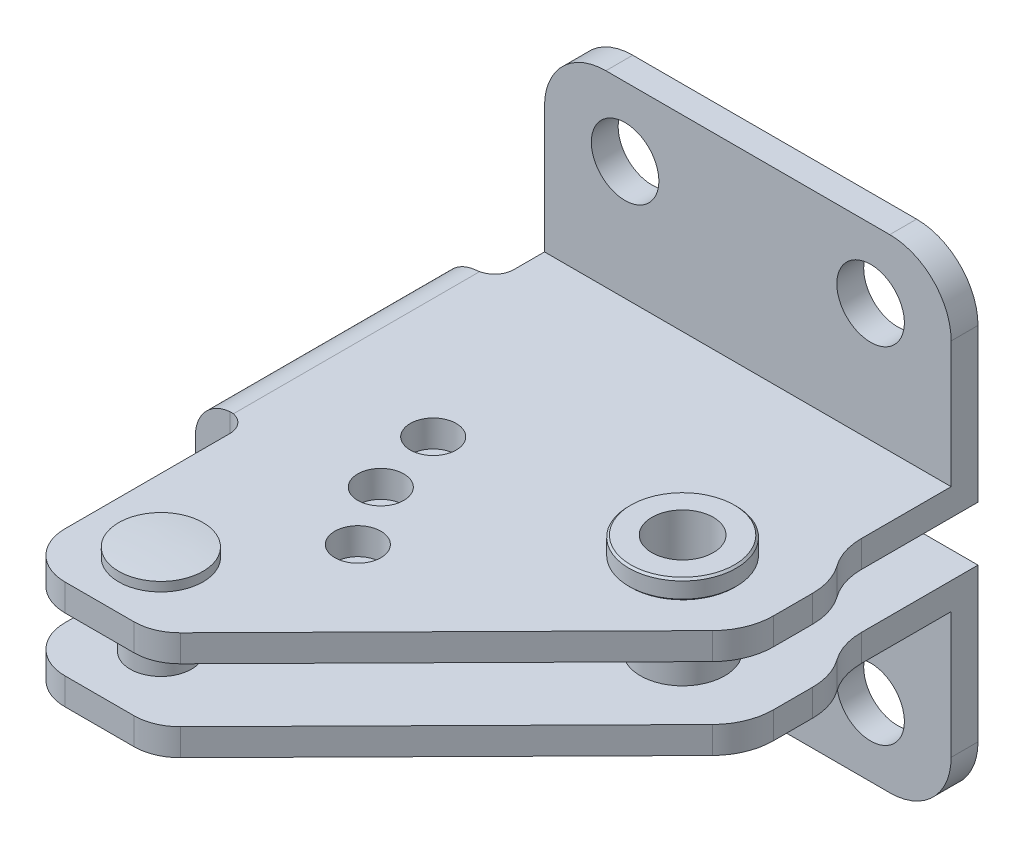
ISO-10303-21;
HEADER;
FILE_DESCRIPTION(('STEP AP214'),'2;1');
FILE_NAME('part.step','',(''),(''),'','','');
FILE_SCHEMA(('AUTOMOTIVE_DESIGN { 1 0 10303 214 1 1 1 1 }'));
ENDSEC;
DATA;
#1=APPLICATION_CONTEXT('core data for automotive mechanical design processes');
#2=APPLICATION_PROTOCOL_DEFINITION('international standard','automotive_design',2000,#1);
#3=PRODUCT_CONTEXT('',#1,'mechanical');
#4=PRODUCT('Part','Part','',(#3));
#5=PRODUCT_RELATED_PRODUCT_CATEGORY('part','',(#4));
#6=PRODUCT_DEFINITION_FORMATION('','',#4);
#7=PRODUCT_DEFINITION_CONTEXT('part definition',#1,'design');
#8=PRODUCT_DEFINITION('design','',#6,#7);
#9=PRODUCT_DEFINITION_SHAPE('','',#8);
#10=(LENGTH_UNIT() NAMED_UNIT(*) SI_UNIT(.MILLI.,.METRE.));
#11=(NAMED_UNIT(*) PLANE_ANGLE_UNIT() SI_UNIT($,.RADIAN.));
#12=(NAMED_UNIT(*) SI_UNIT($,.STERADIAN.) SOLID_ANGLE_UNIT());
#13=UNCERTAINTY_MEASURE_WITH_UNIT(LENGTH_MEASURE(1.E-05),#10,'distance_accuracy_value','');
#14=(GEOMETRIC_REPRESENTATION_CONTEXT(3) GLOBAL_UNCERTAINTY_ASSIGNED_CONTEXT((#13)) GLOBAL_UNIT_ASSIGNED_CONTEXT((#10,
#11,#12)) REPRESENTATION_CONTEXT('',''));
#15=CARTESIAN_POINT('',(0.,0.,0.));
#16=DIRECTION('',(0.,0.,1.));
#17=DIRECTION('',(1.,0.,0.));
#18=AXIS2_PLACEMENT_3D('',#15,#16,#17);
#19=CARTESIAN_POINT('',(33.,12.85,29.));
#20=DIRECTION('',(0.,1.,0.));
#21=DIRECTION('',(1.,0.,0.));
#22=AXIS2_PLACEMENT_3D('',#19,#20,#21);
#23=CYLINDRICAL_SURFACE('',#22,4.);
#24=CARTESIAN_POINT('',(33.,12.9,29.));
#25=DIRECTION('',(0.,1.,0.));
#26=DIRECTION('',(0.,0.,-1.));
#27=AXIS2_PLACEMENT_3D('',#24,#25,#26);
#28=CIRCLE('',#27,4.);
#29=CARTESIAN_POINT('',(33.,12.9,25.));
#30=VERTEX_POINT('',#29);
#31=EDGE_CURVE('E1080',#30,#30,#28,.F.);
#32=ORIENTED_EDGE('',*,*,#31,.T.);
#33=EDGE_LOOP('',(#32));
#34=FACE_BOUND('',#33,.T.);
#35=CARTESIAN_POINT('',(33.,32.1,29.));
#36=DIRECTION('',(0.,-1.,0.));
#37=DIRECTION('',(0.,0.,1.));
#38=AXIS2_PLACEMENT_3D('',#35,#36,#37);
#39=CIRCLE('',#38,4.);
#40=CARTESIAN_POINT('',(33.,32.1,33.));
#41=VERTEX_POINT('',#40);
#42=EDGE_CURVE('E1073',#41,#41,#39,.F.);
#43=ORIENTED_EDGE('',*,*,#42,.T.);
#44=EDGE_LOOP('',(#43));
#45=FACE_BOUND('',#44,.T.);
#46=ADVANCED_FACE('F14',(#34,#45),#23,.F.);
#47=CARTESIAN_POINT('',(33.,15.45,29.));
#48=DIRECTION('',(0.,-1.,0.));
#49=DIRECTION('',(-1.,0.,0.));
#50=AXIS2_PLACEMENT_3D('',#47,#48,#49);
#51=CYLINDRICAL_SURFACE('',#50,7.);
#52=CARTESIAN_POINT('',(33.,13.15,29.));
#53=DIRECTION('',(0.,1.,0.));
#54=DIRECTION('',(0.,0.,-1.));
#55=AXIS2_PLACEMENT_3D('',#52,#53,#54);
#56=CIRCLE('',#55,7.);
#57=CARTESIAN_POINT('',(33.,13.15,22.));
#58=VERTEX_POINT('',#57);
#59=EDGE_CURVE('E23',#58,#58,#56,.T.);
#60=ORIENTED_EDGE('',*,*,#59,.T.);
#61=EDGE_LOOP('',(#60));
#62=FACE_BOUND('',#61,.T.);
#63=CARTESIAN_POINT('',(33.,15.25,29.));
#64=DIRECTION('',(0.,-1.,0.));
#65=DIRECTION('',(-1.,0.,0.));
#66=AXIS2_PLACEMENT_3D('',#63,#64,#65);
#67=CIRCLE('',#66,7.);
#68=CARTESIAN_POINT('',(26.,15.25,29.));
#69=VERTEX_POINT('',#68);
#70=EDGE_CURVE('E1116',#69,#69,#67,.T.);
#71=ORIENTED_EDGE('',*,*,#70,.T.);
#72=EDGE_LOOP('',(#71));
#73=FACE_BOUND('',#72,.T.);
#74=ADVANCED_FACE('F642',(#62,#73),#51,.T.);
#75=CARTESIAN_POINT('',(33.,15.45,29.));
#76=DIRECTION('',(0.,-1.,0.));
#77=DIRECTION('',(-1.,0.,0.));
#78=AXIS2_PLACEMENT_3D('',#75,#76,#77);
#79=CONICAL_SURFACE('',#78,6.8,0.785398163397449);
#80=ORIENTED_EDGE('',*,*,#70,.F.);
#81=EDGE_LOOP('',(#80));
#82=FACE_BOUND('',#81,.T.);
#83=CARTESIAN_POINT('',(33.,15.45,29.));
#84=DIRECTION('',(0.,-1.,0.));
#85=DIRECTION('',(-1.,0.,0.));
#86=AXIS2_PLACEMENT_3D('',#83,#84,#85);
#87=CIRCLE('',#86,6.8);
#88=CARTESIAN_POINT('',(26.2,15.45,29.));
#89=VERTEX_POINT('',#88);
#90=EDGE_CURVE('E637',#89,#89,#87,.T.);
#91=ORIENTED_EDGE('',*,*,#90,.T.);
#92=EDGE_LOOP('',(#91));
#93=FACE_BOUND('',#92,.T.);
#94=ADVANCED_FACE('F663',(#82,#93),#79,.T.);
#95=CARTESIAN_POINT('',(33.,12.85,29.));
#96=DIRECTION('',(0.,1.,0.));
#97=DIRECTION('',(1.,0.,0.));
#98=AXIS2_PLACEMENT_3D('',#95,#96,#97);
#99=CYLINDRICAL_SURFACE('',#98,7.);
#100=CARTESIAN_POINT('',(33.,31.85,29.));
#101=DIRECTION('',(0.,-1.,0.));
#102=DIRECTION('',(0.,0.,1.));
#103=AXIS2_PLACEMENT_3D('',#100,#101,#102);
#104=CIRCLE('',#103,7.);
#105=CARTESIAN_POINT('',(33.,31.85,36.));
#106=VERTEX_POINT('',#105);
#107=EDGE_CURVE('E633',#106,#106,#104,.T.);
#108=ORIENTED_EDGE('',*,*,#107,.T.);
#109=EDGE_LOOP('',(#108));
#110=FACE_BOUND('',#109,.T.);
#111=CARTESIAN_POINT('',(33.,29.8,29.));
#112=DIRECTION('',(0.,1.,0.));
#113=DIRECTION('',(1.,0.,0.));
#114=AXIS2_PLACEMENT_3D('',#111,#112,#113);
#115=CIRCLE('',#114,7.);
#116=CARTESIAN_POINT('',(40.,29.8,29.));
#117=VERTEX_POINT('',#116);
#118=EDGE_CURVE('E1106',#117,#117,#115,.T.);
#119=ORIENTED_EDGE('',*,*,#118,.T.);
#120=EDGE_LOOP('',(#119));
#121=FACE_BOUND('',#120,.T.);
#122=ADVANCED_FACE('F704',(#110,#121),#99,.T.);
#123=CARTESIAN_POINT('',(-1.,-28.9999999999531,62.9999999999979));
#124=DIRECTION('',(0.,1.,0.));
#125=DIRECTION('',(0.,0.,1.));
#126=AXIS2_PLACEMENT_3D('',#123,#124,#125);
#127=SPHERICAL_SURFACE('',#126,59.9999999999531);
#128=CARTESIAN_POINT('',(-1.,30.7473848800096,63.));
#129=DIRECTION('',(0.,1.,0.));
#130=DIRECTION('',(0.,0.,1.));
#131=AXIS2_PLACEMENT_3D('',#128,#129,#130);
#132=CIRCLE('',#131,5.5);
#133=CARTESIAN_POINT('',(-1.,30.7473848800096,68.5));
#134=VERTEX_POINT('',#133);
#135=EDGE_CURVE('E1123',#134,#134,#132,.T.);
#136=ORIENTED_EDGE('',*,*,#135,.T.);
#137=EDGE_LOOP('',(#136));
#138=FACE_BOUND('',#137,.T.);
#139=ADVANCED_FACE('F700',(#138),#127,.T.);
#140=CARTESIAN_POINT('',(34.4999999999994,45.9999999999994,3.5));
#141=DIRECTION('',(0.,0.,-1.));
#142=DIRECTION('',(0.,-1.,0.));
#143=AXIS2_PLACEMENT_3D('',#140,#141,#142);
#144=CYLINDRICAL_SURFACE('',#143,8.00000000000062);
#145=CARTESIAN_POINT('',(34.4999999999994,45.9999999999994,0.));
#146=DIRECTION('',(0.,0.,1.));
#147=DIRECTION('',(-1.,0.,0.));
#148=AXIS2_PLACEMENT_3D('',#145,#146,#147);
#149=CIRCLE('',#148,8.00000000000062);
#150=CARTESIAN_POINT('',(42.5,46.,0.));
#151=VERTEX_POINT('',#150);
#152=CARTESIAN_POINT('',(34.5,54.,0.));
#153=VERTEX_POINT('',#152);
#154=EDGE_CURVE('E587',#151,#153,#149,.T.);
#155=ORIENTED_EDGE('',*,*,#154,.T.);
#156=DIRECTION('',(0.,0.,-1.));
#157=VECTOR('',#156,1.);
#158=CARTESIAN_POINT('',(34.5,54.,3.5));
#159=LINE('',#158,#157);
#160=CARTESIAN_POINT('',(34.5,54.,3.5));
#161=VERTEX_POINT('',#160);
#162=EDGE_CURVE('E2224',#161,#153,#159,.T.);
#163=ORIENTED_EDGE('',*,*,#162,.F.);
#164=CARTESIAN_POINT('',(34.4999999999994,45.9999999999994,3.5));
#165=DIRECTION('',(0.,0.,1.));
#166=DIRECTION('',(-1.,0.,0.));
#167=AXIS2_PLACEMENT_3D('',#164,#165,#166);
#168=CIRCLE('',#167,8.00000000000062);
#169=CARTESIAN_POINT('',(42.5,46.,3.5));
#170=VERTEX_POINT('',#169);
#171=EDGE_CURVE('E2229',#170,#161,#168,.T.);
#172=ORIENTED_EDGE('',*,*,#171,.F.);
#173=DIRECTION('',(0.,0.,-1.));
#174=VECTOR('',#173,1.);
#175=CARTESIAN_POINT('',(42.5,46.,3.5));
#176=LINE('',#175,#174);
#177=EDGE_CURVE('E2187',#170,#151,#176,.T.);
#178=ORIENTED_EDGE('',*,*,#177,.T.);
#179=EDGE_LOOP('',(#155,#163,#172,#178));
#180=FACE_BOUND('',#179,.T.);
#181=ADVANCED_FACE('F703',(#180),#144,.T.);
#182=CARTESIAN_POINT('',(34.5,54.,3.5));
#183=DIRECTION('',(0.,-1.,0.));
#184=DIRECTION('',(1.,0.,0.));
#185=AXIS2_PLACEMENT_3D('',#182,#183,#184);
#186=PLANE('',#185);
#187=DIRECTION('',(-1.,0.,0.));
#188=VECTOR('',#187,1.);
#189=CARTESIAN_POINT('',(34.5,54.,0.));
#190=LINE('',#189,#188);
#191=CARTESIAN_POINT('',(-2.5,54.,0.));
#192=VERTEX_POINT('',#191);
#193=EDGE_CURVE('E1041',#153,#192,#190,.T.);
#194=ORIENTED_EDGE('',*,*,#193,.T.);
#195=DIRECTION('',(0.,0.,-1.));
#196=VECTOR('',#195,1.);
#197=CARTESIAN_POINT('',(-2.5,54.,3.5));
#198=LINE('',#197,#196);
#199=CARTESIAN_POINT('',(-2.5,54.,3.5));
#200=VERTEX_POINT('',#199);
#201=EDGE_CURVE('E2221',#200,#192,#198,.T.);
#202=ORIENTED_EDGE('',*,*,#201,.F.);
#203=DIRECTION('',(-1.,0.,0.));
#204=VECTOR('',#203,1.);
#205=CARTESIAN_POINT('',(34.5,54.,3.5));
#206=LINE('',#205,#204);
#207=EDGE_CURVE('E2232',#161,#200,#206,.T.);
#208=ORIENTED_EDGE('',*,*,#207,.F.);
#209=ORIENTED_EDGE('',*,*,#162,.T.);
#210=EDGE_LOOP('',(#194,#202,#208,#209));
#211=FACE_BOUND('',#210,.T.);
#212=ADVANCED_FACE('F714',(#211),#186,.F.);
#213=CARTESIAN_POINT('',(32.,45.,3.5));
#214=DIRECTION('',(0.,0.,-1.));
#215=DIRECTION('',(0.,-1.,0.));
#216=AXIS2_PLACEMENT_3D('',#213,#214,#215);
#217=CYLINDRICAL_SURFACE('',#216,4.4);
#218=CARTESIAN_POINT('',(32.,45.,3.5));
#219=DIRECTION('',(0.,0.,-1.));
#220=DIRECTION('',(-1.,0.,0.));
#221=AXIS2_PLACEMENT_3D('',#218,#219,#220);
#222=CIRCLE('',#221,4.4);
#223=CARTESIAN_POINT('',(27.6,45.,3.5));
#224=VERTEX_POINT('',#223);
#225=EDGE_CURVE('E1062',#224,#224,#222,.T.);
#226=ORIENTED_EDGE('',*,*,#225,.F.);
#227=EDGE_LOOP('',(#226));
#228=FACE_BOUND('',#227,.T.);
#229=CARTESIAN_POINT('',(32.,45.,0.));
#230=DIRECTION('',(0.,0.,-1.));
#231=DIRECTION('',(-1.,0.,0.));
#232=AXIS2_PLACEMENT_3D('',#229,#230,#231);
#233=CIRCLE('',#232,4.4);
#234=CARTESIAN_POINT('',(27.6,45.,0.));
#235=VERTEX_POINT('',#234);
#236=EDGE_CURVE('E1064',#235,#235,#233,.T.);
#237=ORIENTED_EDGE('',*,*,#236,.T.);
#238=EDGE_LOOP('',(#237));
#239=FACE_BOUND('',#238,.T.);
#240=ADVANCED_FACE('F710',(#228,#239),#217,.F.);
#241=CARTESIAN_POINT('',(0.,45.,3.5));
#242=DIRECTION('',(0.,0.,-1.));
#243=DIRECTION('',(0.,-1.,0.));
#244=AXIS2_PLACEMENT_3D('',#241,#242,#243);
#245=CYLINDRICAL_SURFACE('',#244,4.4);
#246=CARTESIAN_POINT('',(0.,45.,3.5));
#247=DIRECTION('',(0.,0.,-1.));
#248=DIRECTION('',(-1.,0.,0.));
#249=AXIS2_PLACEMENT_3D('',#246,#247,#248);
#250=CIRCLE('',#249,4.4);
#251=CARTESIAN_POINT('',(-4.4,45.,3.5));
#252=VERTEX_POINT('',#251);
#253=EDGE_CURVE('E1068',#252,#252,#250,.T.);
#254=ORIENTED_EDGE('',*,*,#253,.F.);
#255=EDGE_LOOP('',(#254));
#256=FACE_BOUND('',#255,.T.);
#257=CARTESIAN_POINT('',(0.,45.,0.));
#258=DIRECTION('',(0.,0.,-1.));
#259=DIRECTION('',(-1.,0.,0.));
#260=AXIS2_PLACEMENT_3D('',#257,#258,#259);
#261=CIRCLE('',#260,4.4);
#262=CARTESIAN_POINT('',(-4.4,45.,0.));
#263=VERTEX_POINT('',#262);
#264=EDGE_CURVE('E1070',#263,#263,#261,.T.);
#265=ORIENTED_EDGE('',*,*,#264,.T.);
#266=EDGE_LOOP('',(#265));
#267=FACE_BOUND('',#266,.T.);
#268=ADVANCED_FACE('F706',(#256,#267),#245,.F.);
#269=CARTESIAN_POINT('',(-2.49999999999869,45.9999999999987,3.5));
#270=DIRECTION('',(0.,0.,-1.));
#271=DIRECTION('',(0.,-1.,0.));
#272=AXIS2_PLACEMENT_3D('',#269,#270,#271);
#273=CYLINDRICAL_SURFACE('',#272,8.0000000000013);
#274=CARTESIAN_POINT('',(-2.49999999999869,45.9999999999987,0.));
#275=DIRECTION('',(0.,0.,1.));
#276=DIRECTION('',(1.,0.,0.));
#277=AXIS2_PLACEMENT_3D('',#274,#275,#276);
#278=CIRCLE('',#277,8.0000000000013);
#279=CARTESIAN_POINT('',(-10.5,45.9999999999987,0.));
#280=VERTEX_POINT('',#279);
#281=EDGE_CURVE('E1037',#192,#280,#278,.T.);
#282=ORIENTED_EDGE('',*,*,#281,.T.);
#283=DIRECTION('',(0.,0.,-1.));
#284=VECTOR('',#283,1.);
#285=CARTESIAN_POINT('',(-10.5,45.9999999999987,3.5));
#286=LINE('',#285,#284);
#287=CARTESIAN_POINT('',(-10.5,45.9999999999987,3.5));
#288=VERTEX_POINT('',#287);
#289=EDGE_CURVE('E2219',#288,#280,#286,.T.);
#290=ORIENTED_EDGE('',*,*,#289,.F.);
#291=CARTESIAN_POINT('',(-2.49999999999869,45.9999999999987,3.5));
#292=DIRECTION('',(0.,0.,1.));
#293=DIRECTION('',(1.,0.,0.));
#294=AXIS2_PLACEMENT_3D('',#291,#292,#293);
#295=CIRCLE('',#294,8.0000000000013);
#296=EDGE_CURVE('E2234',#200,#288,#295,.T.);
#297=ORIENTED_EDGE('',*,*,#296,.F.);
#298=ORIENTED_EDGE('',*,*,#201,.T.);
#299=EDGE_LOOP('',(#282,#290,#297,#298));
#300=FACE_BOUND('',#299,.T.);
#301=ADVANCED_FACE('F709',(#300),#273,.T.);
#302=CARTESIAN_POINT('',(33.,29.55,29.));
#303=DIRECTION('',(0.,1.,0.));
#304=DIRECTION('',(1.,0.,0.));
#305=AXIS2_PLACEMENT_3D('',#302,#303,#304);
#306=CONICAL_SURFACE('',#305,6.75,0.785398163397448);
#307=ORIENTED_EDGE('',*,*,#118,.F.);
#308=EDGE_LOOP('',(#307));
#309=FACE_BOUND('',#308,.T.);
#310=CARTESIAN_POINT('',(33.,29.55,29.));
#311=DIRECTION('',(0.,1.,0.));
#312=DIRECTION('',(1.,0.,0.));
#313=AXIS2_PLACEMENT_3D('',#310,#311,#312);
#314=CIRCLE('',#313,6.75);
#315=CARTESIAN_POINT('',(39.75,29.55,29.));
#316=VERTEX_POINT('',#315);
#317=EDGE_CURVE('E1103',#316,#316,#314,.T.);
#318=ORIENTED_EDGE('',*,*,#317,.T.);
#319=EDGE_LOOP('',(#318));
#320=FACE_BOUND('',#319,.T.);
#321=ADVANCED_FACE('F698',(#309,#320),#306,.T.);
#322=CARTESIAN_POINT('',(-1.,18.0877132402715,63.));
#323=DIRECTION('',(0.,1.,0.));
#324=DIRECTION('',(0.,0.,1.));
#325=AXIS2_PLACEMENT_3D('',#322,#323,#324);
#326=CYLINDRICAL_SURFACE('',#325,5.5);
#327=CARTESIAN_POINT('',(-1.,29.55,63.));
#328=DIRECTION('',(0.,1.,0.));
#329=DIRECTION('',(0.,0.,-1.));
#330=AXIS2_PLACEMENT_3D('',#327,#328,#329);
#331=CIRCLE('',#330,5.5);
#332=CARTESIAN_POINT('',(-1.,29.55,57.5));
#333=VERTEX_POINT('',#332);
#334=EDGE_CURVE('E605',#333,#333,#331,.F.);
#335=ORIENTED_EDGE('',*,*,#334,.F.);
#336=EDGE_LOOP('',(#335));
#337=FACE_BOUND('',#336,.T.);
#338=ORIENTED_EDGE('',*,*,#135,.F.);
#339=EDGE_LOOP('',(#338));
#340=FACE_BOUND('',#339,.T.);
#341=ADVANCED_FACE('F694',(#337,#340),#326,.T.);
#342=CARTESIAN_POINT('',(34.4999999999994,45.9999999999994,3.5));
#343=DIRECTION('',(0.,0.,1.));
#344=DIRECTION('',(0.,1.,0.));
#345=AXIS2_PLACEMENT_3D('',#342,#343,#344);
#346=PLANE('',#345);
#347=ORIENTED_EDGE('',*,*,#253,.T.);
#348=EDGE_LOOP('',(#347));
#349=FACE_BOUND('',#348,.T.);
#350=ORIENTED_EDGE('',*,*,#225,.T.);
#351=EDGE_LOOP('',(#350));
#352=FACE_BOUND('',#351,.T.);
#353=DIRECTION('',(0.,-1.,0.));
#354=VECTOR('',#353,1.);
#355=CARTESIAN_POINT('',(-10.5,46.,3.5));
#356=LINE('',#355,#354);
#357=CARTESIAN_POINT('',(-10.5,29.55,3.5));
#358=VERTEX_POINT('',#357);
#359=EDGE_CURVE('E2238',#288,#358,#356,.T.);
#360=ORIENTED_EDGE('',*,*,#359,.T.);
#361=DIRECTION('',(1.,0.,0.));
#362=VECTOR('',#361,1.);
#363=CARTESIAN_POINT('',(37.5000000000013,29.55,3.5));
#364=LINE('',#363,#362);
#365=CARTESIAN_POINT('',(42.5,29.55,3.5));
#366=VERTEX_POINT('',#365);
#367=EDGE_CURVE('E461',#358,#366,#364,.T.);
#368=ORIENTED_EDGE('',*,*,#367,.T.);
#369=DIRECTION('',(0.,1.,0.));
#370=VECTOR('',#369,1.);
#371=CARTESIAN_POINT('',(42.5,-1.,3.5));
#372=LINE('',#371,#370);
#373=EDGE_CURVE('E1028',#366,#170,#372,.T.);
#374=ORIENTED_EDGE('',*,*,#373,.T.);
#375=ORIENTED_EDGE('',*,*,#171,.T.);
#376=ORIENTED_EDGE('',*,*,#207,.T.);
#377=ORIENTED_EDGE('',*,*,#296,.T.);
#378=EDGE_LOOP('',(#360,#368,#374,#375,#376,#377));
#379=FACE_BOUND('',#378,.T.);
#380=ADVANCED_FACE('F697',(#349,#352,#379),#346,.T.);
#381=CARTESIAN_POINT('',(10.358712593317,29.55,48.681770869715));
#382=DIRECTION('',(0.,-1.,0.));
#383=DIRECTION('',(1.,0.,0.));
#384=AXIS2_PLACEMENT_3D('',#381,#382,#383);
#385=CYLINDRICAL_SURFACE('',#384,3.);
#386=CARTESIAN_POINT('',(10.358712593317,26.05,48.681770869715));
#387=DIRECTION('',(0.,-1.,0.));
#388=DIRECTION('',(1.,0.,0.));
#389=AXIS2_PLACEMENT_3D('',#386,#387,#388);
#390=CIRCLE('',#389,3.);
#391=CARTESIAN_POINT('',(13.358712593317,26.05,48.681770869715));
#392=VERTEX_POINT('',#391);
#393=EDGE_CURVE('E629',#392,#392,#390,.F.);
#394=ORIENTED_EDGE('',*,*,#393,.F.);
#395=EDGE_LOOP('',(#394));
#396=FACE_BOUND('',#395,.T.);
#397=CARTESIAN_POINT('',(10.358712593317,29.55,48.681770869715));
#398=DIRECTION('',(0.,1.,0.));
#399=DIRECTION('',(-1.,0.,0.));
#400=AXIS2_PLACEMENT_3D('',#397,#398,#399);
#401=CIRCLE('',#400,3.);
#402=CARTESIAN_POINT('',(7.358712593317,29.55,48.681770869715));
#403=VERTEX_POINT('',#402);
#404=EDGE_CURVE('E632',#403,#403,#401,.T.);
#405=ORIENTED_EDGE('',*,*,#404,.T.);
#406=EDGE_LOOP('',(#405));
#407=FACE_BOUND('',#406,.T.);
#408=ADVANCED_FACE('F726',(#396,#407),#385,.F.);
#409=CARTESIAN_POINT('',(3.114159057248,29.55,31.61467228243));
#410=DIRECTION('',(0.,-1.,0.));
#411=DIRECTION('',(1.,0.,0.));
#412=AXIS2_PLACEMENT_3D('',#409,#410,#411);
#413=CYLINDRICAL_SURFACE('',#412,3.);
#414=CARTESIAN_POINT('',(3.114159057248,26.05,31.61467228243));
#415=DIRECTION('',(0.,-1.,0.));
#416=DIRECTION('',(1.,0.,0.));
#417=AXIS2_PLACEMENT_3D('',#414,#415,#416);
#418=CIRCLE('',#417,3.);
#419=CARTESIAN_POINT('',(6.114159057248,26.05,31.61467228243));
#420=VERTEX_POINT('',#419);
#421=EDGE_CURVE('E613',#420,#420,#418,.F.);
#422=ORIENTED_EDGE('',*,*,#421,.F.);
#423=EDGE_LOOP('',(#422));
#424=FACE_BOUND('',#423,.T.);
#425=CARTESIAN_POINT('',(3.114159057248,29.55,31.61467228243));
#426=DIRECTION('',(0.,1.,0.));
#427=DIRECTION('',(-1.,0.,0.));
#428=AXIS2_PLACEMENT_3D('',#425,#426,#427);
#429=CIRCLE('',#428,3.);
#430=CARTESIAN_POINT('',(0.114159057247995,29.55,31.61467228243));
#431=VERTEX_POINT('',#430);
#432=EDGE_CURVE('E616',#431,#431,#429,.T.);
#433=ORIENTED_EDGE('',*,*,#432,.T.);
#434=EDGE_LOOP('',(#433));
#435=FACE_BOUND('',#434,.T.);
#436=ADVANCED_FACE('F729',(#424,#435),#413,.F.);
#437=CARTESIAN_POINT('',(-4.499999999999,15.45,65.999999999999));
#438=DIRECTION('',(0.,1.,0.));
#439=DIRECTION('',(-1.,0.,0.));
#440=AXIS2_PLACEMENT_3D('',#437,#438,#439);
#441=CYLINDRICAL_SURFACE('',#440,6.00000000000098);
#442=DIRECTION('',(0.,1.,0.));
#443=VECTOR('',#442,1.);
#444=CARTESIAN_POINT('',(-10.5,15.45,66.));
#445=LINE('',#444,#443);
#446=CARTESIAN_POINT('',(-10.5,26.05,66.));
#447=VERTEX_POINT('',#446);
#448=CARTESIAN_POINT('',(-10.5,29.55,66.));
#449=VERTEX_POINT('',#448);
#450=EDGE_CURVE('E416',#447,#449,#445,.T.);
#451=ORIENTED_EDGE('',*,*,#450,.F.);
#452=CARTESIAN_POINT('',(-4.499999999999,26.05,65.999999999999));
#453=DIRECTION('',(0.,-1.,0.));
#454=DIRECTION('',(1.,0.,0.));
#455=AXIS2_PLACEMENT_3D('',#452,#453,#454);
#456=CIRCLE('',#455,6.00000000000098);
#457=CARTESIAN_POINT('',(-4.5,26.05,72.));
#458=VERTEX_POINT('',#457);
#459=EDGE_CURVE('E818',#447,#458,#456,.F.);
#460=ORIENTED_EDGE('',*,*,#459,.T.);
#461=DIRECTION('',(0.,1.,0.));
#462=VECTOR('',#461,1.);
#463=CARTESIAN_POINT('',(-4.5,15.45,72.));
#464=LINE('',#463,#462);
#465=CARTESIAN_POINT('',(-4.5,29.55,72.));
#466=VERTEX_POINT('',#465);
#467=EDGE_CURVE('E412',#458,#466,#464,.T.);
#468=ORIENTED_EDGE('',*,*,#467,.T.);
#469=CARTESIAN_POINT('',(-4.499999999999,29.55,65.999999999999));
#470=DIRECTION('',(0.,1.,0.));
#471=DIRECTION('',(-1.,0.,0.));
#472=AXIS2_PLACEMENT_3D('',#469,#470,#471);
#473=CIRCLE('',#472,6.00000000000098);
#474=EDGE_CURVE('E335',#449,#466,#473,.T.);
#475=ORIENTED_EDGE('',*,*,#474,.F.);
#476=EDGE_LOOP('',(#451,#460,#468,#475));
#477=FACE_BOUND('',#476,.T.);
#478=ADVANCED_FACE('F742',(#477),#441,.T.);
#479=CARTESIAN_POINT('',(-4.5,15.45,72.));
#480=DIRECTION('',(0.,0.,1.));
#481=DIRECTION('',(0.,1.,0.));
#482=AXIS2_PLACEMENT_3D('',#479,#480,#481);
#483=PLANE('',#482);
#484=ORIENTED_EDGE('',*,*,#467,.F.);
#485=DIRECTION('',(1.,0.,0.));
#486=VECTOR('',#485,1.);
#487=CARTESIAN_POINT('',(-4.5,26.05,72.));
#488=LINE('',#487,#486);
#489=CARTESIAN_POINT('',(4.5,26.05,72.));
#490=VERTEX_POINT('',#489);
#491=EDGE_CURVE('E815',#458,#490,#488,.T.);
#492=ORIENTED_EDGE('',*,*,#491,.T.);
#493=DIRECTION('',(0.,1.,0.));
#494=VECTOR('',#493,1.);
#495=CARTESIAN_POINT('',(4.5,15.45,72.));
#496=LINE('',#495,#494);
#497=CARTESIAN_POINT('',(4.5,29.55,72.));
#498=VERTEX_POINT('',#497);
#499=EDGE_CURVE('E408',#490,#498,#496,.T.);
#500=ORIENTED_EDGE('',*,*,#499,.T.);
#501=DIRECTION('',(1.,0.,0.));
#502=VECTOR('',#501,1.);
#503=CARTESIAN_POINT('',(-4.5,29.55,72.));
#504=LINE('',#503,#502);
#505=EDGE_CURVE('E343',#466,#498,#504,.T.);
#506=ORIENTED_EDGE('',*,*,#505,.F.);
#507=EDGE_LOOP('',(#484,#492,#500,#506));
#508=FACE_BOUND('',#507,.T.);
#509=ADVANCED_FACE('F748',(#508),#483,.T.);
#510=CARTESIAN_POINT('',(4.5000000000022,15.45,66.0000000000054));
#511=DIRECTION('',(0.,1.,0.));
#512=DIRECTION('',(-1.,0.,0.));
#513=AXIS2_PLACEMENT_3D('',#510,#511,#512);
#514=CYLINDRICAL_SURFACE('',#513,5.99999999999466);
#515=ORIENTED_EDGE('',*,*,#499,.F.);
#516=CARTESIAN_POINT('',(4.5000000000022,26.05,66.0000000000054));
#517=DIRECTION('',(0.,-1.,0.));
#518=DIRECTION('',(1.,0.,0.));
#519=AXIS2_PLACEMENT_3D('',#516,#517,#518);
#520=CIRCLE('',#519,5.99999999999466);
#521=CARTESIAN_POINT('',(8.773218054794,26.05,70.211841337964));
#522=VERTEX_POINT('',#521);
#523=EDGE_CURVE('E812',#490,#522,#520,.F.);
#524=ORIENTED_EDGE('',*,*,#523,.T.);
#525=DIRECTION('',(0.,1.,0.));
#526=VECTOR('',#525,1.);
#527=CARTESIAN_POINT('',(8.773218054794,15.45,70.211841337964));
#528=LINE('',#527,#526);
#529=CARTESIAN_POINT('',(8.773218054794,29.55,70.211841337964));
#530=VERTEX_POINT('',#529);
#531=EDGE_CURVE('E404',#522,#530,#528,.T.);
#532=ORIENTED_EDGE('',*,*,#531,.T.);
#533=CARTESIAN_POINT('',(4.5000000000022,29.55,66.0000000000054));
#534=DIRECTION('',(0.,1.,0.));
#535=DIRECTION('',(-1.,0.,0.));
#536=AXIS2_PLACEMENT_3D('',#533,#534,#535);
#537=CIRCLE('',#536,5.99999999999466);
#538=EDGE_CURVE('E346',#498,#530,#537,.T.);
#539=ORIENTED_EDGE('',*,*,#538,.F.);
#540=EDGE_LOOP('',(#515,#524,#532,#539));
#541=FACE_BOUND('',#540,.T.);
#542=ADVANCED_FACE('F944',(#541),#514,.T.);
#543=CARTESIAN_POINT('',(8.773218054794,15.45,70.211841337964));
#544=DIRECTION('',(0.712203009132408,0.,0.701973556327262));
#545=DIRECTION('',(0.701973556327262,0.,-0.712203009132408));
#546=AXIS2_PLACEMENT_3D('',#543,#544,#545);
#547=PLANE('',#546);
#548=ORIENTED_EDGE('',*,*,#531,.F.);
#549=DIRECTION('',(0.701973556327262,0.,-0.712203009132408));
#550=VECTOR('',#549,1.);
#551=CARTESIAN_POINT('',(8.773218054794,26.05,70.211841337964));
#552=LINE('',#551,#550);
#553=CARTESIAN_POINT('',(43.1976240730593,26.05,35.285788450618));
#554=VERTEX_POINT('',#553);
#555=EDGE_CURVE('E809',#522,#554,#552,.T.);
#556=ORIENTED_EDGE('',*,*,#555,.T.);
#557=DIRECTION('',(0.,1.,0.));
#558=VECTOR('',#557,1.);
#559=CARTESIAN_POINT('',(43.1976240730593,15.45,35.285788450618));
#560=LINE('',#559,#558);
#561=CARTESIAN_POINT('',(43.1976240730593,29.55,35.285788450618));
#562=VERTEX_POINT('',#561);
#563=EDGE_CURVE('E400',#554,#562,#560,.T.);
#564=ORIENTED_EDGE('',*,*,#563,.T.);
#565=DIRECTION('',(0.701973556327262,0.,-0.712203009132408));
#566=VECTOR('',#565,1.);
#567=CARTESIAN_POINT('',(8.773218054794,29.55,70.211841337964));
#568=LINE('',#567,#566);
#569=EDGE_CURVE('E349',#530,#562,#568,.T.);
#570=ORIENTED_EDGE('',*,*,#569,.F.);
#571=EDGE_LOOP('',(#548,#556,#564,#570));
#572=FACE_BOUND('',#571,.T.);
#573=ADVANCED_FACE('F939',(#572),#547,.T.);
#574=CARTESIAN_POINT('',(37.5,15.45,29.67));
#575=DIRECTION('',(0.,1.,0.));
#576=DIRECTION('',(-1.,0.,0.));
#577=AXIS2_PLACEMENT_3D('',#574,#575,#576);
#578=CYLINDRICAL_SURFACE('',#577,8.00000000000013);
#579=ORIENTED_EDGE('',*,*,#563,.F.);
#580=CARTESIAN_POINT('',(37.5,26.05,29.67));
#581=DIRECTION('',(0.,-1.,0.));
#582=DIRECTION('',(1.,0.,0.));
#583=AXIS2_PLACEMENT_3D('',#580,#581,#582);
#584=CIRCLE('',#583,8.00000000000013);
#585=CARTESIAN_POINT('',(45.5,26.05,29.67));
#586=VERTEX_POINT('',#585);
#587=EDGE_CURVE('E464',#554,#586,#584,.F.);
#588=ORIENTED_EDGE('',*,*,#587,.T.);
#589=DIRECTION('',(0.,1.,0.));
#590=VECTOR('',#589,1.);
#591=CARTESIAN_POINT('',(45.5,15.45,29.67));
#592=LINE('',#591,#590);
#593=CARTESIAN_POINT('',(45.5,29.55,29.67));
#594=VERTEX_POINT('',#593);
#595=EDGE_CURVE('E394',#586,#594,#592,.T.);
#596=ORIENTED_EDGE('',*,*,#595,.T.);
#597=CARTESIAN_POINT('',(37.5,29.55,29.67));
#598=DIRECTION('',(0.,1.,0.));
#599=DIRECTION('',(-1.,0.,0.));
#600=AXIS2_PLACEMENT_3D('',#597,#598,#599);
#601=CIRCLE('',#600,8.00000000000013);
#602=EDGE_CURVE('E352',#562,#594,#601,.T.);
#603=ORIENTED_EDGE('',*,*,#602,.F.);
#604=EDGE_LOOP('',(#579,#588,#596,#603));
#605=FACE_BOUND('',#604,.T.);
#606=ADVANCED_FACE('F934',(#605),#578,.T.);
#607=CARTESIAN_POINT('',(45.5,15.45,29.67));
#608=DIRECTION('',(1.,0.,0.));
#609=DIRECTION('',(0.,1.,0.));
#610=AXIS2_PLACEMENT_3D('',#607,#608,#609);
#611=PLANE('',#610);
#612=ORIENTED_EDGE('',*,*,#595,.F.);
#613=DIRECTION('',(0.,0.,-1.));
#614=VECTOR('',#613,1.);
#615=CARTESIAN_POINT('',(45.5,26.05,29.67));
#616=LINE('',#615,#614);
#617=CARTESIAN_POINT('',(45.5,26.05,24.54));
#618=VERTEX_POINT('',#617);
#619=EDGE_CURVE('E825',#586,#618,#616,.T.);
#620=ORIENTED_EDGE('',*,*,#619,.T.);
#621=DIRECTION('',(0.,1.,0.));
#622=VECTOR('',#621,1.);
#623=CARTESIAN_POINT('',(45.5,15.45,24.54));
#624=LINE('',#623,#622);
#625=CARTESIAN_POINT('',(45.5,29.55,24.54));
#626=VERTEX_POINT('',#625);
#627=EDGE_CURVE('E457',#618,#626,#624,.T.);
#628=ORIENTED_EDGE('',*,*,#627,.T.);
#629=DIRECTION('',(0.,0.,-1.));
#630=VECTOR('',#629,1.);
#631=CARTESIAN_POINT('',(45.5,29.55,29.67));
#632=LINE('',#631,#630);
#633=EDGE_CURVE('E356',#594,#626,#632,.T.);
#634=ORIENTED_EDGE('',*,*,#633,.F.);
#635=EDGE_LOOP('',(#612,#620,#628,#634));
#636=FACE_BOUND('',#635,.T.);
#637=ADVANCED_FACE('F980',(#636),#611,.T.);
#638=CARTESIAN_POINT('',(37.5000000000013,15.45,24.54));
#639=DIRECTION('',(0.,1.,0.));
#640=DIRECTION('',(-1.,0.,0.));
#641=AXIS2_PLACEMENT_3D('',#638,#639,#640);
#642=CYLINDRICAL_SURFACE('',#641,7.99999999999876);
#643=ORIENTED_EDGE('',*,*,#627,.F.);
#644=CARTESIAN_POINT('',(37.5000000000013,26.05,24.54));
#645=DIRECTION('',(0.,-1.,0.));
#646=DIRECTION('',(1.,0.,0.));
#647=AXIS2_PLACEMENT_3D('',#644,#645,#646);
#648=CIRCLE('',#647,7.99999999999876);
#649=CARTESIAN_POINT('',(44.,26.05,19.876310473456));
#650=VERTEX_POINT('',#649);
#651=EDGE_CURVE('E828',#618,#650,#648,.F.);
#652=ORIENTED_EDGE('',*,*,#651,.T.);
#653=DIRECTION('',(0.,1.,0.));
#654=VECTOR('',#653,1.);
#655=CARTESIAN_POINT('',(44.,15.45,19.876310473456));
#656=LINE('',#655,#654);
#657=CARTESIAN_POINT('',(44.,29.55,19.876310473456));
#658=VERTEX_POINT('',#657);
#659=EDGE_CURVE('E453',#650,#658,#656,.T.);
#660=ORIENTED_EDGE('',*,*,#659,.T.);
#661=CARTESIAN_POINT('',(37.5000000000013,29.55,24.54));
#662=DIRECTION('',(0.,1.,0.));
#663=DIRECTION('',(-1.,0.,0.));
#664=AXIS2_PLACEMENT_3D('',#661,#662,#663);
#665=CIRCLE('',#664,7.99999999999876);
#666=EDGE_CURVE('E359',#626,#658,#665,.T.);
#667=ORIENTED_EDGE('',*,*,#666,.F.);
#668=EDGE_LOOP('',(#643,#652,#660,#667));
#669=FACE_BOUND('',#668,.T.);
#670=ADVANCED_FACE('F1572',(#669),#642,.T.);
#671=CARTESIAN_POINT('',(50.5000000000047,15.45,15.2126209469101));
#672=DIRECTION('',(0.,1.,0.));
#673=DIRECTION('',(-1.,0.,0.));
#674=AXIS2_PLACEMENT_3D('',#671,#672,#673);
#675=CYLINDRICAL_SURFACE('',#674,8.00000000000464);
#676=ORIENTED_EDGE('',*,*,#659,.F.);
#677=CARTESIAN_POINT('',(50.5000000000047,26.05,15.2126209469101));
#678=DIRECTION('',(0.,-1.,0.));
#679=DIRECTION('',(1.,0.,0.));
#680=AXIS2_PLACEMENT_3D('',#677,#678,#679);
#681=CIRCLE('',#680,8.00000000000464);
#682=CARTESIAN_POINT('',(42.5,26.05,15.2126209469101));
#683=VERTEX_POINT('',#682);
#684=EDGE_CURVE('E831',#650,#683,#681,.T.);
#685=ORIENTED_EDGE('',*,*,#684,.T.);
#686=DIRECTION('',(0.,1.,0.));
#687=VECTOR('',#686,1.);
#688=CARTESIAN_POINT('',(42.5,15.45,15.2126209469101));
#689=LINE('',#688,#687);
#690=CARTESIAN_POINT('',(42.5,29.55,15.2126209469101));
#691=VERTEX_POINT('',#690);
#692=EDGE_CURVE('E449',#683,#691,#689,.T.);
#693=ORIENTED_EDGE('',*,*,#692,.T.);
#694=CARTESIAN_POINT('',(50.5000000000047,29.55,15.2126209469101));
#695=DIRECTION('',(0.,-1.,0.));
#696=DIRECTION('',(1.,0.,0.));
#697=AXIS2_PLACEMENT_3D('',#694,#695,#696);
#698=CIRCLE('',#697,8.00000000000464);
#699=EDGE_CURVE('E986',#658,#691,#698,.T.);
#700=ORIENTED_EDGE('',*,*,#699,.F.);
#701=EDGE_LOOP('',(#676,#685,#693,#700));
#702=FACE_BOUND('',#701,.T.);
#703=ADVANCED_FACE('F992',(#702),#675,.F.);
#704=CARTESIAN_POINT('',(42.5,15.45,15.212620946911));
#705=DIRECTION('',(1.,0.,0.));
#706=DIRECTION('',(0.,1.,0.));
#707=AXIS2_PLACEMENT_3D('',#704,#705,#706);
#708=PLANE('',#707);
#709=ORIENTED_EDGE('',*,*,#692,.F.);
#710=DIRECTION('',(0.,0.,-1.));
#711=VECTOR('',#710,1.);
#712=CARTESIAN_POINT('',(42.5,26.05,15.212620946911));
#713=LINE('',#712,#711);
#714=CARTESIAN_POINT('',(42.5,26.05,0.));
#715=VERTEX_POINT('',#714);
#716=EDGE_CURVE('E834',#683,#715,#713,.T.);
#717=ORIENTED_EDGE('',*,*,#716,.T.);
#718=DIRECTION('',(0.,1.,0.));
#719=VECTOR('',#718,1.);
#720=CARTESIAN_POINT('',(42.5,15.45,0.));
#721=LINE('',#720,#719);
#722=EDGE_CURVE('E444',#715,#151,#721,.T.);
#723=ORIENTED_EDGE('',*,*,#722,.T.);
#724=ORIENTED_EDGE('',*,*,#177,.F.);
#725=ORIENTED_EDGE('',*,*,#373,.F.);
#726=DIRECTION('',(0.,0.,-1.));
#727=VECTOR('',#726,1.);
#728=CARTESIAN_POINT('',(42.5,29.55,15.212620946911));
#729=LINE('',#728,#727);
#730=EDGE_CURVE('E994',#691,#366,#729,.T.);
#731=ORIENTED_EDGE('',*,*,#730,.F.);
#732=EDGE_LOOP('',(#709,#717,#723,#724,#725,#731));
#733=FACE_BOUND('',#732,.T.);
#734=ADVANCED_FACE('F1420',(#733),#708,.T.);
#735=CARTESIAN_POINT('',(42.5,15.45,0.));
#736=DIRECTION('',(0.,0.,-1.));
#737=DIRECTION('',(0.,-1.,0.));
#738=AXIS2_PLACEMENT_3D('',#735,#736,#737);
#739=PLANE('',#738);
#740=ORIENTED_EDGE('',*,*,#264,.F.);
#741=EDGE_LOOP('',(#740));
#742=FACE_BOUND('',#741,.T.);
#743=ORIENTED_EDGE('',*,*,#236,.F.);
#744=EDGE_LOOP('',(#743));
#745=FACE_BOUND('',#744,.T.);
#746=ORIENTED_EDGE('',*,*,#722,.F.);
#747=DIRECTION('',(-1.,0.,0.));
#748=VECTOR('',#747,1.);
#749=CARTESIAN_POINT('',(49.,26.05,0.));
#750=LINE('',#749,#748);
#751=CARTESIAN_POINT('',(-10.5,26.05,0.));
#752=VERTEX_POINT('',#751);
#753=EDGE_CURVE('E792',#715,#752,#750,.T.);
#754=ORIENTED_EDGE('',*,*,#753,.T.);
#755=DIRECTION('',(0.,1.,0.));
#756=VECTOR('',#755,1.);
#757=CARTESIAN_POINT('',(-10.5,15.45,0.));
#758=LINE('',#757,#756);
#759=EDGE_CURVE('E439',#752,#280,#758,.T.);
#760=ORIENTED_EDGE('',*,*,#759,.T.);
#761=ORIENTED_EDGE('',*,*,#281,.F.);
#762=ORIENTED_EDGE('',*,*,#193,.F.);
#763=ORIENTED_EDGE('',*,*,#154,.F.);
#764=EDGE_LOOP('',(#746,#754,#760,#761,#762,#763));
#765=FACE_BOUND('',#764,.T.);
#766=ADVANCED_FACE('F737',(#742,#745,#765),#739,.T.);
#767=CARTESIAN_POINT('',(5.384854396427,29.55,40.721933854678));
#768=DIRECTION('',(0.,-1.,0.));
#769=DIRECTION('',(1.,0.,0.));
#770=AXIS2_PLACEMENT_3D('',#767,#768,#769);
#771=CYLINDRICAL_SURFACE('',#770,3.);
#772=CARTESIAN_POINT('',(5.384854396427,26.05,40.721933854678));
#773=DIRECTION('',(0.,-1.,0.));
#774=DIRECTION('',(1.,0.,0.));
#775=AXIS2_PLACEMENT_3D('',#772,#773,#774);
#776=CIRCLE('',#775,3.);
#777=CARTESIAN_POINT('',(8.384854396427,26.05,40.721933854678));
#778=VERTEX_POINT('',#777);
#779=EDGE_CURVE('E621',#778,#778,#776,.F.);
#780=ORIENTED_EDGE('',*,*,#779,.F.);
#781=EDGE_LOOP('',(#780));
#782=FACE_BOUND('',#781,.T.);
#783=CARTESIAN_POINT('',(5.384854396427,29.55,40.721933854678));
#784=DIRECTION('',(0.,1.,0.));
#785=DIRECTION('',(-1.,0.,0.));
#786=AXIS2_PLACEMENT_3D('',#783,#784,#785);
#787=CIRCLE('',#786,3.);
#788=CARTESIAN_POINT('',(2.384854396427,29.55,40.721933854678));
#789=VERTEX_POINT('',#788);
#790=EDGE_CURVE('E624',#789,#789,#787,.T.);
#791=ORIENTED_EDGE('',*,*,#790,.T.);
#792=EDGE_LOOP('',(#791));
#793=FACE_BOUND('',#792,.T.);
#794=ADVANCED_FACE('F674',(#782,#793),#771,.F.);
#795=CARTESIAN_POINT('',(-1.,16.5,63.));
#796=DIRECTION('',(0.,-1.,0.));
#797=DIRECTION('',(0.,0.,-1.));
#798=AXIS2_PLACEMENT_3D('',#795,#796,#797);
#799=CONICAL_SURFACE('',#798,2.75,1.04719755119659);
#800=CARTESIAN_POINT('',(-1.,18.0877132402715,63.));
#801=VERTEX_POINT('',#800);
#802=VERTEX_LOOP('',#801);
#803=FACE_BOUND('',#802,.T.);
#804=CARTESIAN_POINT('',(-1.,16.5,63.));
#805=DIRECTION('',(0.,1.,0.));
#806=DIRECTION('',(0.,0.,1.));
#807=AXIS2_PLACEMENT_3D('',#804,#805,#806);
#808=CIRCLE('',#807,2.75);
#809=CARTESIAN_POINT('',(-1.,16.5,65.75));
#810=VERTEX_POINT('',#809);
#811=EDGE_CURVE('E597',#810,#810,#808,.T.);
#812=ORIENTED_EDGE('',*,*,#811,.F.);
#813=EDGE_LOOP('',(#812));
#814=FACE_BOUND('',#813,.T.);
#815=ADVANCED_FACE('F670',(#803,#814),#799,.F.);
#816=CARTESIAN_POINT('',(-10.5,15.45,0.));
#817=DIRECTION('',(-1.,0.,0.));
#818=DIRECTION('',(0.,-1.,0.));
#819=AXIS2_PLACEMENT_3D('',#816,#817,#818);
#820=PLANE('',#819);
#821=ORIENTED_EDGE('',*,*,#759,.F.);
#822=DIRECTION('',(0.,0.,1.));
#823=VECTOR('',#822,1.);
#824=CARTESIAN_POINT('',(-10.5,26.05,0.));
#825=LINE('',#824,#823);
#826=CARTESIAN_POINT('',(-10.5,26.05,7.49999999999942));
#827=VERTEX_POINT('',#826);
#828=EDGE_CURVE('E838',#752,#827,#825,.T.);
#829=ORIENTED_EDGE('',*,*,#828,.T.);
#830=DIRECTION('',(0.,1.,0.));
#831=VECTOR('',#830,1.);
#832=CARTESIAN_POINT('',(-10.5,15.45,7.5));
#833=LINE('',#832,#831);
#834=CARTESIAN_POINT('',(-10.5,29.55,7.5));
#835=VERTEX_POINT('',#834);
#836=EDGE_CURVE('E435',#827,#835,#833,.T.);
#837=ORIENTED_EDGE('',*,*,#836,.T.);
#838=DIRECTION('',(0.,0.,1.));
#839=VECTOR('',#838,1.);
#840=CARTESIAN_POINT('',(-10.5,29.55,0.));
#841=LINE('',#840,#839);
#842=EDGE_CURVE('E337',#358,#835,#841,.T.);
#843=ORIENTED_EDGE('',*,*,#842,.F.);
#844=ORIENTED_EDGE('',*,*,#359,.F.);
#845=ORIENTED_EDGE('',*,*,#289,.T.);
#846=EDGE_LOOP('',(#821,#829,#837,#843,#844,#845));
#847=FACE_BOUND('',#846,.T.);
#848=ADVANCED_FACE('F673',(#847),#820,.T.);
#849=CARTESIAN_POINT('',(-10.5,15.45,44.5));
#850=DIRECTION('',(-1.,0.,0.));
#851=DIRECTION('',(0.,-1.,0.));
#852=AXIS2_PLACEMENT_3D('',#849,#850,#851);
#853=PLANE('',#852);
#854=DIRECTION('',(0.,1.,0.));
#855=VECTOR('',#854,1.);
#856=CARTESIAN_POINT('',(-10.5,15.45,44.5));
#857=LINE('',#856,#855);
#858=CARTESIAN_POINT('',(-10.5,26.05,44.5));
#859=VERTEX_POINT('',#858);
#860=CARTESIAN_POINT('',(-10.5,29.55,44.5));
#861=VERTEX_POINT('',#860);
#862=EDGE_CURVE('E331',#859,#861,#857,.T.);
#863=ORIENTED_EDGE('',*,*,#862,.F.);
#864=DIRECTION('',(0.,0.,1.));
#865=VECTOR('',#864,1.);
#866=CARTESIAN_POINT('',(-10.5,26.05,44.5));
#867=LINE('',#866,#865);
#868=EDGE_CURVE('E821',#859,#447,#867,.T.);
#869=ORIENTED_EDGE('',*,*,#868,.T.);
#870=ORIENTED_EDGE('',*,*,#450,.T.);
#871=DIRECTION('',(0.,0.,1.));
#872=VECTOR('',#871,1.);
#873=CARTESIAN_POINT('',(-10.5,29.55,44.5));
#874=LINE('',#873,#872);
#875=EDGE_CURVE('E333',#861,#449,#874,.T.);
#876=ORIENTED_EDGE('',*,*,#875,.F.);
#877=EDGE_LOOP('',(#863,#869,#870,#876));
#878=FACE_BOUND('',#877,.T.);
#879=ADVANCED_FACE('F923',(#878),#853,.T.);
#880=CARTESIAN_POINT('',(37.5000000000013,29.55,24.54));
#881=DIRECTION('',(0.,1.,0.));
#882=DIRECTION('',(-1.,0.,0.));
#883=AXIS2_PLACEMENT_3D('',#880,#881,#882);
#884=PLANE('',#883);
#885=ORIENTED_EDGE('',*,*,#404,.F.);
#886=EDGE_LOOP('',(#885));
#887=FACE_BOUND('',#886,.T.);
#888=ORIENTED_EDGE('',*,*,#432,.F.);
#889=EDGE_LOOP('',(#888));
#890=FACE_BOUND('',#889,.T.);
#891=DIRECTION('',(0.,0.,-1.));
#892=VECTOR('',#891,1.);
#893=CARTESIAN_POINT('',(-12.5,29.55,77.5));
#894=LINE('',#893,#892);
#895=CARTESIAN_POINT('',(-12.5,29.55,42.050510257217));
#896=VERTEX_POINT('',#895);
#897=CARTESIAN_POINT('',(-12.5,29.55,9.94948974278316));
#898=VERTEX_POINT('',#897);
#899=EDGE_CURVE('E306',#896,#898,#894,.T.);
#900=ORIENTED_EDGE('',*,*,#899,.F.);
#901=CARTESIAN_POINT('',(-13.0000000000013,29.55,44.5000000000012));
#902=DIRECTION('',(0.,-1.,0.));
#903=DIRECTION('',(-1.,0.,0.));
#904=AXIS2_PLACEMENT_3D('',#901,#902,#903);
#905=CIRCLE('',#904,2.50000000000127);
#906=EDGE_CURVE('E320',#896,#861,#905,.T.);
#907=ORIENTED_EDGE('',*,*,#906,.T.);
#908=ORIENTED_EDGE('',*,*,#875,.T.);
#909=ORIENTED_EDGE('',*,*,#474,.T.);
#910=ORIENTED_EDGE('',*,*,#505,.T.);
#911=ORIENTED_EDGE('',*,*,#538,.T.);
#912=ORIENTED_EDGE('',*,*,#569,.T.);
#913=ORIENTED_EDGE('',*,*,#602,.T.);
#914=ORIENTED_EDGE('',*,*,#633,.T.);
#915=ORIENTED_EDGE('',*,*,#666,.T.);
#916=ORIENTED_EDGE('',*,*,#699,.T.);
#917=ORIENTED_EDGE('',*,*,#730,.T.);
#918=ORIENTED_EDGE('',*,*,#367,.F.);
#919=ORIENTED_EDGE('',*,*,#842,.T.);
#920=CARTESIAN_POINT('',(-13.,29.55,7.49999999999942));
#921=DIRECTION('',(0.,-1.,0.));
#922=DIRECTION('',(-1.,0.,0.));
#923=AXIS2_PLACEMENT_3D('',#920,#921,#922);
#924=CIRCLE('',#923,2.50000000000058);
#925=EDGE_CURVE('E324',#835,#898,#924,.T.);
#926=ORIENTED_EDGE('',*,*,#925,.T.);
#927=EDGE_LOOP('',(#900,#907,#908,#909,#910,#911,#912,#913,#914,#915,#916,#917,#918,#919,#926));
#928=FACE_BOUND('',#927,.T.);
#929=ORIENTED_EDGE('',*,*,#790,.F.);
#930=EDGE_LOOP('',(#929));
#931=FACE_BOUND('',#930,.T.);
#932=ORIENTED_EDGE('',*,*,#334,.T.);
#933=EDGE_LOOP('',(#932));
#934=FACE_BOUND('',#933,.T.);
#935=ORIENTED_EDGE('',*,*,#317,.F.);
#936=EDGE_LOOP('',(#935));
#937=FACE_BOUND('',#936,.T.);
#938=ADVANCED_FACE('F317',(#887,#890,#928,#931,#934,#937),#884,.T.);
#939=CARTESIAN_POINT('',(49.,26.05,74.));
#940=DIRECTION('',(0.,-1.,0.));
#941=DIRECTION('',(1.,0.,0.));
#942=AXIS2_PLACEMENT_3D('',#939,#940,#941);
#943=PLANE('',#942);
#944=ORIENTED_EDGE('',*,*,#779,.T.);
#945=EDGE_LOOP('',(#944));
#946=FACE_BOUND('',#945,.T.);
#947=ORIENTED_EDGE('',*,*,#753,.F.);
#948=ORIENTED_EDGE('',*,*,#716,.F.);
#949=ORIENTED_EDGE('',*,*,#684,.F.);
#950=ORIENTED_EDGE('',*,*,#651,.F.);
#951=ORIENTED_EDGE('',*,*,#619,.F.);
#952=ORIENTED_EDGE('',*,*,#587,.F.);
#953=ORIENTED_EDGE('',*,*,#555,.F.);
#954=ORIENTED_EDGE('',*,*,#523,.F.);
#955=ORIENTED_EDGE('',*,*,#491,.F.);
#956=ORIENTED_EDGE('',*,*,#459,.F.);
#957=ORIENTED_EDGE('',*,*,#868,.F.);
#958=CARTESIAN_POINT('',(-13.0000000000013,26.05,44.5000000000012));
#959=DIRECTION('',(0.,-1.,0.));
#960=DIRECTION('',(1.,0.,0.));
#961=AXIS2_PLACEMENT_3D('',#958,#959,#960);
#962=CIRCLE('',#961,2.50000000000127);
#963=CARTESIAN_POINT('',(-12.5,26.05,42.0505102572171));
#964=VERTEX_POINT('',#963);
#965=EDGE_CURVE('E596',#964,#859,#962,.T.);
#966=ORIENTED_EDGE('',*,*,#965,.F.);
#967=DIRECTION('',(0.,0.,-1.));
#968=VECTOR('',#967,1.);
#969=CARTESIAN_POINT('',(-12.5,26.05,74.));
#970=LINE('',#969,#968);
#971=CARTESIAN_POINT('',(-12.5,26.05,9.94948974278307));
#972=VERTEX_POINT('',#971);
#973=EDGE_CURVE('E807',#964,#972,#970,.T.);
#974=ORIENTED_EDGE('',*,*,#973,.T.);
#975=CARTESIAN_POINT('',(-13.,26.05,7.49999999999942));
#976=DIRECTION('',(0.,-1.,0.));
#977=DIRECTION('',(1.,0.,0.));
#978=AXIS2_PLACEMENT_3D('',#975,#976,#977);
#979=CIRCLE('',#978,2.50000000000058);
#980=EDGE_CURVE('E580',#827,#972,#979,.T.);
#981=ORIENTED_EDGE('',*,*,#980,.F.);
#982=ORIENTED_EDGE('',*,*,#828,.F.);
#983=EDGE_LOOP('',(#947,#948,#949,#950,#951,#952,#953,#954,#955,#956,#957,#966,#974,#981,#982));
#984=FACE_BOUND('',#983,.T.);
#985=CARTESIAN_POINT('',(-1.,26.05,63.));
#986=DIRECTION('',(0.,-1.,0.));
#987=DIRECTION('',(1.,0.,0.));
#988=AXIS2_PLACEMENT_3D('',#985,#986,#987);
#989=CIRCLE('',#988,4.);
#990=CARTESIAN_POINT('',(3.,26.05,63.));
#991=VERTEX_POINT('',#990);
#992=EDGE_CURVE('E606',#991,#991,#989,.F.);
#993=ORIENTED_EDGE('',*,*,#992,.T.);
#994=EDGE_LOOP('',(#993));
#995=FACE_BOUND('',#994,.T.);
#996=ORIENTED_EDGE('',*,*,#421,.T.);
#997=EDGE_LOOP('',(#996));
#998=FACE_BOUND('',#997,.T.);
#999=ORIENTED_EDGE('',*,*,#393,.T.);
#1000=EDGE_LOOP('',(#999));
#1001=FACE_BOUND('',#1000,.T.);
#1002=CARTESIAN_POINT('',(33.,26.05,29.));
#1003=DIRECTION('',(0.,-1.,0.));
#1004=DIRECTION('',(0.,0.,1.));
#1005=AXIS2_PLACEMENT_3D('',#1002,#1003,#1004);
#1006=CIRCLE('',#1005,5.5);
#1007=CARTESIAN_POINT('',(33.,26.05,34.5));
#1008=VERTEX_POINT('',#1007);
#1009=EDGE_CURVE('E1105',#1008,#1008,#1006,.T.);
#1010=ORIENTED_EDGE('',*,*,#1009,.F.);
#1011=EDGE_LOOP('',(#1010));
#1012=FACE_BOUND('',#1011,.T.);
#1013=ADVANCED_FACE('F679',(#946,#984,#995,#998,#1001,#1012),#943,.T.);
#1014=CARTESIAN_POINT('',(-1.,18.0877132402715,63.));
#1015=DIRECTION('',(0.,1.,0.));
#1016=DIRECTION('',(0.,0.,1.));
#1017=AXIS2_PLACEMENT_3D('',#1014,#1015,#1016);
#1018=CYLINDRICAL_SURFACE('',#1017,2.75);
#1019=ORIENTED_EDGE('',*,*,#811,.T.);
#1020=EDGE_LOOP('',(#1019));
#1021=FACE_BOUND('',#1020,.T.);
#1022=CARTESIAN_POINT('',(-1.,14.0630539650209,63.));
#1023=DIRECTION('',(0.,1.,0.));
#1024=DIRECTION('',(0.,0.,1.));
#1025=AXIS2_PLACEMENT_3D('',#1022,#1023,#1024);
#1026=CIRCLE('',#1025,2.75);
#1027=CARTESIAN_POINT('',(-1.,14.0630539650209,60.2500000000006));
#1028=VERTEX_POINT('',#1027);
#1029=EDGE_CURVE('E599',#1028,#1028,#1026,.T.);
#1030=ORIENTED_EDGE('',*,*,#1029,.F.);
#1031=EDGE_LOOP('',(#1030));
#1032=FACE_BOUND('',#1031,.T.);
#1033=ADVANCED_FACE('F675',(#1021,#1032),#1018,.F.);
#1034=CARTESIAN_POINT('',(-1.,18.0877132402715,63.));
#1035=DIRECTION('',(0.,1.,0.));
#1036=DIRECTION('',(0.,0.,1.));
#1037=AXIS2_PLACEMENT_3D('',#1034,#1035,#1036);
#1038=CYLINDRICAL_SURFACE('',#1037,4.);
#1039=ORIENTED_EDGE('',*,*,#992,.F.);
#1040=EDGE_LOOP('',(#1039));
#1041=FACE_BOUND('',#1040,.T.);
#1042=CARTESIAN_POINT('',(-1.,18.95,63.));
#1043=DIRECTION('',(0.,1.,0.));
#1044=DIRECTION('',(-1.,0.,0.));
#1045=AXIS2_PLACEMENT_3D('',#1042,#1043,#1044);
#1046=CIRCLE('',#1045,4.);
#1047=CARTESIAN_POINT('',(-5.,18.95,63.));
#1048=VERTEX_POINT('',#1047);
#1049=EDGE_CURVE('E602',#1048,#1048,#1046,.T.);
#1050=ORIENTED_EDGE('',*,*,#1049,.T.);
#1051=EDGE_LOOP('',(#1050));
#1052=FACE_BOUND('',#1051,.T.);
#1053=ADVANCED_FACE('F678',(#1041,#1052),#1038,.T.);
#1054=CARTESIAN_POINT('',(33.,12.85,29.));
#1055=DIRECTION('',(0.,1.,0.));
#1056=DIRECTION('',(1.,0.,0.));
#1057=AXIS2_PLACEMENT_3D('',#1054,#1055,#1056);
#1058=CYLINDRICAL_SURFACE('',#1057,5.5);
#1059=CARTESIAN_POINT('',(33.,18.95,29.));
#1060=DIRECTION('',(0.,1.,0.));
#1061=DIRECTION('',(0.,0.,-1.));
#1062=AXIS2_PLACEMENT_3D('',#1059,#1060,#1061);
#1063=CIRCLE('',#1062,5.5);
#1064=CARTESIAN_POINT('',(33.,18.95,23.5));
#1065=VERTEX_POINT('',#1064);
#1066=EDGE_CURVE('E1109',#1065,#1065,#1063,.T.);
#1067=ORIENTED_EDGE('',*,*,#1066,.T.);
#1068=EDGE_LOOP('',(#1067));
#1069=FACE_BOUND('',#1068,.T.);
#1070=ORIENTED_EDGE('',*,*,#1009,.T.);
#1071=EDGE_LOOP('',(#1070));
#1072=FACE_BOUND('',#1071,.T.);
#1073=ADVANCED_FACE('F521',(#1069,#1072),#1058,.T.);
#1074=CARTESIAN_POINT('',(-13.,15.45,7.49999999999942));
#1075=DIRECTION('',(0.,1.,0.));
#1076=DIRECTION('',(-1.,0.,0.));
#1077=AXIS2_PLACEMENT_3D('',#1074,#1075,#1076);
#1078=CYLINDRICAL_SURFACE('',#1077,2.50000000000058);
#1079=DIRECTION('',(0.,1.,0.));
#1080=VECTOR('',#1079,1.);
#1081=CARTESIAN_POINT('',(-13.,15.45,10.));
#1082=LINE('',#1081,#1080);
#1083=CARTESIAN_POINT('',(-13.,25.9642135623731,10.));
#1084=VERTEX_POINT('',#1083);
#1085=CARTESIAN_POINT('',(-13.,29.5249371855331,10.));
#1086=VERTEX_POINT('',#1085);
#1087=EDGE_CURVE('E432',#1084,#1086,#1082,.T.);
#1088=ORIENTED_EDGE('',*,*,#1087,.T.);
#1089=CARTESIAN_POINT('',(-13.,29.5249371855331,10.));
#1090=CARTESIAN_POINT('',(-12.958125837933,29.5291476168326,10.0000018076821));
#1091=CARTESIAN_POINT('',(-12.9161978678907,29.5328255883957,9.9989479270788));
#1092=CARTESIAN_POINT('',(-12.8325005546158,29.5391075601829,9.99473283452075));
#1093=CARTESIAN_POINT('',(-12.7907311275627,29.5417149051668,9.99157826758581));
#1094=CARTESIAN_POINT('',(-12.7073517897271,29.5458730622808,9.98316587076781));
#1095=CARTESIAN_POINT('',(-12.6657418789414,29.5474238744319,9.97790804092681));
#1096=CARTESIAN_POINT('',(-12.5826828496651,29.549489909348,9.96528269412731));
#1097=CARTESIAN_POINT('',(-12.5412346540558,29.5500018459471,9.95790856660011));
#1098=CARTESIAN_POINT('',(-12.5,29.55,9.94948974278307));
#1099=B_SPLINE_CURVE_WITH_KNOTS('',3,(#1089,#1090,#1091,#1092,#1093,#1094,#1095,#1096,#1097,
#1098),.UNSPECIFIED.,.F.,.F.,(4,2,2,2,4),(0.,0.126239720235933,0.25208199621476,
0.377924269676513,0.504163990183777),.UNSPECIFIED.);
#1100=EDGE_CURVE('E539',#1086,#898,#1099,.T.);
#1101=ORIENTED_EDGE('',*,*,#1100,.T.);
#1102=ORIENTED_EDGE('',*,*,#925,.F.);
#1103=ORIENTED_EDGE('',*,*,#836,.F.);
#1104=ORIENTED_EDGE('',*,*,#980,.T.);
#1105=CARTESIAN_POINT('',(-12.5,26.05,9.94948974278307));
#1106=CARTESIAN_POINT('',(-12.5420957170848,26.0500110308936,9.95809445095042));
#1107=CARTESIAN_POINT('',(-12.5844212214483,26.048227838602,9.96559167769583));
#1108=CARTESIAN_POINT('',(-12.6686908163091,26.0410755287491,9.9783094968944));
#1109=CARTESIAN_POINT('',(-12.7106346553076,26.0357411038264,9.98355131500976));
#1110=CARTESIAN_POINT('',(-12.7941271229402,26.0214899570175,9.99186214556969));
#1111=CARTESIAN_POINT('',(-12.8356757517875,26.0125732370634,9.99493115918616));
#1112=CARTESIAN_POINT('',(-12.9183635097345,25.9911183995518,9.99901554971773));
#1113=CARTESIAN_POINT('',(-12.9594947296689,25.9785459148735,10.0000106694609));
#1114=CARTESIAN_POINT('',(-13.,25.9642135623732,10.));
#1115=B_SPLINE_CURVE_WITH_KNOTS('',3,(#1105,#1106,#1107,#1108,#1109,#1110,#1111,#1112,#1113,
#1114),.UNSPECIFIED.,.F.,.F.,(4,2,2,2,4),(0.,0.128851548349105,0.256462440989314,
0.384073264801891,0.512924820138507),.UNSPECIFIED.);
#1116=EDGE_CURVE('E532',#972,#1084,#1115,.T.);
#1117=ORIENTED_EDGE('',*,*,#1116,.T.);
#1118=EDGE_LOOP('',(#1088,#1101,#1102,#1103,#1104,#1117));
#1119=FACE_BOUND('',#1118,.T.);
#1120=ADVANCED_FACE('F516',(#1119),#1078,.F.);
#1121=CARTESIAN_POINT('',(-12.5,24.5500000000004,77.5));
#1122=DIRECTION('',(0.,0.,-1.));
#1123=DIRECTION('',(0.,-1.,0.));
#1124=AXIS2_PLACEMENT_3D('',#1121,#1122,#1123);
#1125=CYLINDRICAL_SURFACE('',#1124,4.99999999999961);
#1126=CARTESIAN_POINT('',(-12.5,24.5500000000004,10.));
#1127=DIRECTION('',(0.,0.,-1.));
#1128=DIRECTION('',(0.,-1.,0.));
#1129=AXIS2_PLACEMENT_3D('',#1126,#1127,#1128);
#1130=CIRCLE('',#1129,4.99999999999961);
#1131=CARTESIAN_POINT('',(-17.5,24.55,10.));
#1132=VERTEX_POINT('',#1131);
#1133=EDGE_CURVE('E547',#1132,#1086,#1130,.T.);
#1134=ORIENTED_EDGE('',*,*,#1133,.F.);
#1135=DIRECTION('',(0.,0.,-1.));
#1136=VECTOR('',#1135,1.);
#1137=CARTESIAN_POINT('',(-17.5,24.55,77.5));
#1138=LINE('',#1137,#1136);
#1139=CARTESIAN_POINT('',(-17.5,24.55,42.));
#1140=VERTEX_POINT('',#1139);
#1141=EDGE_CURVE('E325',#1140,#1132,#1138,.T.);
#1142=ORIENTED_EDGE('',*,*,#1141,.F.);
#1143=CARTESIAN_POINT('',(-12.5,24.5500000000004,42.));
#1144=DIRECTION('',(0.,0.,1.));
#1145=DIRECTION('',(0.,1.,0.));
#1146=AXIS2_PLACEMENT_3D('',#1143,#1144,#1145);
#1147=CIRCLE('',#1146,4.99999999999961);
#1148=CARTESIAN_POINT('',(-13.,29.5249371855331,42.));
#1149=VERTEX_POINT('',#1148);
#1150=EDGE_CURVE('E309',#1149,#1140,#1147,.T.);
#1151=ORIENTED_EDGE('',*,*,#1150,.F.);
#1152=CARTESIAN_POINT('',(-12.5,29.55,42.0505102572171));
#1153=CARTESIAN_POINT('',(-12.5412346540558,29.5500018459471,42.0420914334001));
#1154=CARTESIAN_POINT('',(-12.5826828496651,29.549489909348,42.0347173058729));
#1155=CARTESIAN_POINT('',(-12.6657418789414,29.5474238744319,42.0220919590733));
#1156=CARTESIAN_POINT('',(-12.7073517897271,29.5458730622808,42.0168341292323));
#1157=CARTESIAN_POINT('',(-12.7907311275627,29.5417149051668,42.0084217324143));
#1158=CARTESIAN_POINT('',(-12.8325005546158,29.5391075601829,42.0052671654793));
#1159=CARTESIAN_POINT('',(-12.9161978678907,29.5328255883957,42.0010520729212));
#1160=CARTESIAN_POINT('',(-12.958125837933,29.5291476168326,41.999998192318));
#1161=CARTESIAN_POINT('',(-13.,29.5249371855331,42.));
#1162=B_SPLINE_CURVE_WITH_KNOTS('',3,(#1152,#1153,#1154,#1155,#1156,#1157,#1158,#1159,#1160,
#1161),.UNSPECIFIED.,.F.,.F.,(4,2,2,2,4),(0.,0.126239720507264,0.252081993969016,
0.377924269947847,0.504163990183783),.UNSPECIFIED.);
#1163=EDGE_CURVE('E303',#896,#1149,#1162,.T.);
#1164=ORIENTED_EDGE('',*,*,#1163,.F.);
#1165=ORIENTED_EDGE('',*,*,#899,.T.);
#1166=ORIENTED_EDGE('',*,*,#1100,.F.);
#1167=EDGE_LOOP('',(#1134,#1142,#1151,#1164,#1165,#1166));
#1168=FACE_BOUND('',#1167,.T.);
#1169=ADVANCED_FACE('F305',(#1168),#1125,.T.);
#1170=CARTESIAN_POINT('',(-13.0000000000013,15.45,44.5000000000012));
#1171=DIRECTION('',(0.,1.,0.));
#1172=DIRECTION('',(-1.,0.,0.));
#1173=AXIS2_PLACEMENT_3D('',#1170,#1171,#1172);
#1174=CYLINDRICAL_SURFACE('',#1173,2.50000000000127);
#1175=ORIENTED_EDGE('',*,*,#906,.F.);
#1176=ORIENTED_EDGE('',*,*,#1163,.T.);
#1177=DIRECTION('',(0.,1.,0.));
#1178=VECTOR('',#1177,1.);
#1179=CARTESIAN_POINT('',(-13.,15.45,42.));
#1180=LINE('',#1179,#1178);
#1181=CARTESIAN_POINT('',(-13.,25.9642135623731,42.));
#1182=VERTEX_POINT('',#1181);
#1183=EDGE_CURVE('E423',#1182,#1149,#1180,.T.);
#1184=ORIENTED_EDGE('',*,*,#1183,.F.);
#1185=CARTESIAN_POINT('',(-13.,25.9642135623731,42.));
#1186=CARTESIAN_POINT('',(-12.9594947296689,25.9785459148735,41.9999893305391));
#1187=CARTESIAN_POINT('',(-12.9183635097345,25.9911183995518,42.0009844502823));
#1188=CARTESIAN_POINT('',(-12.8356757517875,26.0125732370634,42.0050688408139));
#1189=CARTESIAN_POINT('',(-12.7941271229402,26.0214899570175,42.0081378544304));
#1190=CARTESIAN_POINT('',(-12.7106346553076,26.0357411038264,42.0164486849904));
#1191=CARTESIAN_POINT('',(-12.6686908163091,26.0410755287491,42.0216905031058));
#1192=CARTESIAN_POINT('',(-12.5844212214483,26.048227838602,42.0344083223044));
#1193=CARTESIAN_POINT('',(-12.5420957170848,26.0500110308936,42.0419055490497));
#1194=CARTESIAN_POINT('',(-12.5,26.05,42.0505102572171));
#1195=B_SPLINE_CURVE_WITH_KNOTS('',3,(#1185,#1186,#1187,#1188,#1189,#1190,#1191,#1192,#1193,
#1194),.UNSPECIFIED.,.F.,.F.,(4,2,2,2,4),(0.,0.128851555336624,0.25646237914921,
0.384073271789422,0.512924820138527),.UNSPECIFIED.);
#1196=EDGE_CURVE('E479',#1182,#964,#1195,.T.);
#1197=ORIENTED_EDGE('',*,*,#1196,.T.);
#1198=ORIENTED_EDGE('',*,*,#965,.T.);
#1199=ORIENTED_EDGE('',*,*,#862,.T.);
#1200=EDGE_LOOP('',(#1175,#1176,#1184,#1197,#1198,#1199));
#1201=FACE_BOUND('',#1200,.T.);
#1202=ADVANCED_FACE('F328',(#1201),#1174,.F.);
#1203=CARTESIAN_POINT('',(-12.5,24.5500000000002,74.));
#1204=DIRECTION('',(0.,0.,-1.));
#1205=DIRECTION('',(0.,-1.,0.));
#1206=AXIS2_PLACEMENT_3D('',#1203,#1204,#1205);
#1207=CYLINDRICAL_SURFACE('',#1206,1.49999999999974);
#1208=ORIENTED_EDGE('',*,*,#973,.F.);
#1209=ORIENTED_EDGE('',*,*,#1196,.F.);
#1210=CARTESIAN_POINT('',(-12.5,24.5500000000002,42.));
#1211=DIRECTION('',(0.,0.,1.));
#1212=DIRECTION('',(0.,1.,0.));
#1213=AXIS2_PLACEMENT_3D('',#1210,#1211,#1212);
#1214=CIRCLE('',#1213,1.49999999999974);
#1215=CARTESIAN_POINT('',(-14.,24.55,42.));
#1216=VERTEX_POINT('',#1215);
#1217=EDGE_CURVE('E512',#1216,#1182,#1214,.F.);
#1218=ORIENTED_EDGE('',*,*,#1217,.F.);
#1219=DIRECTION('',(0.,0.,-1.));
#1220=VECTOR('',#1219,1.);
#1221=CARTESIAN_POINT('',(-14.,24.55,74.));
#1222=LINE('',#1221,#1220);
#1223=CARTESIAN_POINT('',(-14.,24.55,10.));
#1224=VERTEX_POINT('',#1223);
#1225=EDGE_CURVE('E805',#1216,#1224,#1222,.T.);
#1226=ORIENTED_EDGE('',*,*,#1225,.T.);
#1227=CARTESIAN_POINT('',(-12.5,24.5500000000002,10.));
#1228=DIRECTION('',(0.,0.,-1.));
#1229=DIRECTION('',(0.,-1.,0.));
#1230=AXIS2_PLACEMENT_3D('',#1227,#1228,#1229);
#1231=CIRCLE('',#1230,1.49999999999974);
#1232=EDGE_CURVE('E585',#1084,#1224,#1231,.F.);
#1233=ORIENTED_EDGE('',*,*,#1232,.F.);
#1234=ORIENTED_EDGE('',*,*,#1116,.F.);
#1235=EDGE_LOOP('',(#1208,#1209,#1218,#1226,#1233,#1234));
#1236=FACE_BOUND('',#1235,.T.);
#1237=ADVANCED_FACE('F882',(#1236),#1207,.F.);
#1238=CARTESIAN_POINT('',(-14.,24.55,74.));
#1239=DIRECTION('',(1.,0.,0.));
#1240=DIRECTION('',(0.,1.,0.));
#1241=AXIS2_PLACEMENT_3D('',#1238,#1239,#1240);
#1242=PLANE('',#1241);
#1243=ORIENTED_EDGE('',*,*,#1225,.F.);
#1244=DIRECTION('',(0.,1.,0.));
#1245=VECTOR('',#1244,1.);
#1246=CARTESIAN_POINT('',(-14.,15.45,42.));
#1247=LINE('',#1246,#1245);
#1248=CARTESIAN_POINT('',(-14.,20.45,42.));
#1249=VERTEX_POINT('',#1248);
#1250=EDGE_CURVE('E592',#1249,#1216,#1247,.T.);
#1251=ORIENTED_EDGE('',*,*,#1250,.F.);
#1252=DIRECTION('',(0.,0.,-1.));
#1253=VECTOR('',#1252,1.);
#1254=CARTESIAN_POINT('',(-14.,20.45,74.));
#1255=LINE('',#1254,#1253);
#1256=CARTESIAN_POINT('',(-14.,20.45,10.));
#1257=VERTEX_POINT('',#1256);
#1258=EDGE_CURVE('E802',#1249,#1257,#1255,.T.);
#1259=ORIENTED_EDGE('',*,*,#1258,.T.);
#1260=DIRECTION('',(0.,-1.,0.));
#1261=VECTOR('',#1260,1.);
#1262=CARTESIAN_POINT('',(-14.,15.45,10.));
#1263=LINE('',#1262,#1261);
#1264=EDGE_CURVE('E584',#1224,#1257,#1263,.T.);
#1265=ORIENTED_EDGE('',*,*,#1264,.F.);
#1266=EDGE_LOOP('',(#1243,#1251,#1259,#1265));
#1267=FACE_BOUND('',#1266,.T.);
#1268=ADVANCED_FACE('F500',(#1267),#1242,.T.);
#1269=CARTESIAN_POINT('',(-1.,74.0000000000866,63.0000000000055));
#1270=DIRECTION('',(0.,1.,0.));
#1271=DIRECTION('',(0.,0.,-1.));
#1272=AXIS2_PLACEMENT_3D('',#1269,#1270,#1271);
#1273=SPHERICAL_SURFACE('',#1272,60.0000000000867);
#1274=CARTESIAN_POINT('',(-1.,14.2526151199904,63.));
#1275=DIRECTION('',(0.,1.,0.));
#1276=DIRECTION('',(0.,0.,1.));
#1277=AXIS2_PLACEMENT_3D('',#1274,#1275,#1276);
#1278=CIRCLE('',#1277,5.5);
#1279=CARTESIAN_POINT('',(-1.,14.2526151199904,57.5000000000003));
#1280=VERTEX_POINT('',#1279);
#1281=EDGE_CURVE('E1120',#1280,#1280,#1278,.T.);
#1282=CARTESIAN_POINT('',(-1.,14.0630539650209,60.2500000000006));
#1283=CARTESIAN_POINT('',(-1.,14.0643701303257,60.2213138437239));
#1284=CARTESIAN_POINT('',(-1.,14.0657068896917,60.1926286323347));
#1285=CARTESIAN_POINT('',(-1.,14.0684215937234,60.1352601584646));
#1286=CARTESIAN_POINT('',(-1.,14.0697995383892,60.1065768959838));
#1287=CARTESIAN_POINT('',(-1.,14.0725966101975,60.0492123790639));
#1288=CARTESIAN_POINT('',(-1.,14.0740157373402,60.0205311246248));
#1289=CARTESIAN_POINT('',(-1.,14.076895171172,59.9631706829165));
#1290=CARTESIAN_POINT('',(-1.,14.0783554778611,59.9344914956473));
#1291=CARTESIAN_POINT('',(-1.,14.0813172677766,59.8771352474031));
#1292=CARTESIAN_POINT('',(-1.,14.082818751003,59.848458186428));
#1293=CARTESIAN_POINT('',(-1.,14.0858628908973,59.7911062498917));
#1294=CARTESIAN_POINT('',(-1.,14.0874055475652,59.7624313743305));
#1295=CARTESIAN_POINT('',(-1.,14.0905320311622,59.7050838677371));
#1296=CARTESIAN_POINT('',(-1.,14.0921158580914,59.676411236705));
#1297=CARTESIAN_POINT('',(-1.,14.0953246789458,59.6190682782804));
#1298=CARTESIAN_POINT('',(-1.,14.0969496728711,59.590397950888));
#1299=CARTESIAN_POINT('',(-1.,14.1002408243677,59.5330596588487));
#1300=CARTESIAN_POINT('',(-1.,14.1019069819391,59.5043916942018));
#1301=CARTESIAN_POINT('',(-1.,14.1052804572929,59.4470581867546));
#1302=CARTESIAN_POINT('',(-1.,14.1069877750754,59.4183926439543));
#1303=CARTESIAN_POINT('',(-1.,14.1104435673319,59.3610640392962));
#1304=CARTESIAN_POINT('',(-1.,14.1121920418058,59.3324009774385));
#1305=CARTESIAN_POINT('',(-1.,14.1157301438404,59.2750773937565));
#1306=CARTESIAN_POINT('',(-1.,14.1175197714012,59.2464168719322));
#1307=CARTESIAN_POINT('',(-1.,14.12114017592,59.1890984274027));
#1308=CARTESIAN_POINT('',(-1.,14.1229709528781,59.1604405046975));
#1309=CARTESIAN_POINT('',(-1.,14.1266736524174,59.1031273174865));
#1310=CARTESIAN_POINT('',(-1.,14.1285455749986,59.0744720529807));
#1311=CARTESIAN_POINT('',(-1.,14.132330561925,59.0171642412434));
#1312=CARTESIAN_POINT('',(-1.,14.1342436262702,58.9885116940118));
#1313=CARTESIAN_POINT('',(-1.,14.1381108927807,58.931209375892));
#1314=CARTESIAN_POINT('',(-1.,14.140065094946,58.9025596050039));
#1315=CARTESIAN_POINT('',(-1.,14.144014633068,58.8452628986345));
#1316=CARTESIAN_POINT('',(-1.,14.1460099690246,58.8166159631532));
#1317=CARTESIAN_POINT('',(-1.,14.1500417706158,58.7593249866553));
#1318=CARTESIAN_POINT('',(-1.,14.1520782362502,58.7306809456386));
#1319=CARTESIAN_POINT('',(-1.,14.1561922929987,58.6733958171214));
#1320=CARTESIAN_POINT('',(-1.,14.1582698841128,58.6447547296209));
#1321=CARTESIAN_POINT('',(-1.,14.1624661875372,58.5874755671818));
#1322=CARTESIAN_POINT('',(-1.,14.1645848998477,58.5588374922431));
#1323=CARTESIAN_POINT('',(-1.,14.1688634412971,58.501564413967));
#1324=CARTESIAN_POINT('',(-1.,14.1710232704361,58.4729294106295));
#1325=CARTESIAN_POINT('',(-1.,14.17538404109,58.4156625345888));
#1326=CARTESIAN_POINT('',(-1.,14.1775849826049,58.3870306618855));
#1327=CARTESIAN_POINT('',(-1.,14.1820279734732,58.3297701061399));
#1328=CARTESIAN_POINT('',(-1.,14.1842700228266,58.3011414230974));
#1329=CARTESIAN_POINT('',(-1.,14.1887952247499,58.2438873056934));
#1330=CARTESIAN_POINT('',(-1.,14.1910783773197,58.2152618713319));
#1331=CARTESIAN_POINT('',(-1.,14.1956857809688,58.1580143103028));
#1332=CARTESIAN_POINT('',(-1.,14.1980100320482,58.1293921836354));
#1333=CARTESIAN_POINT('',(-1.,14.2026996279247,58.0721512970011));
#1334=CARTESIAN_POINT('',(-1.,14.2050649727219,58.0435325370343));
#1335=CARTESIAN_POINT('',(-1.,14.2098367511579,57.986298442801));
#1336=CARTESIAN_POINT('',(-1.,14.2122431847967,57.9576831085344));
#1337=CARTESIAN_POINT('',(-1.,14.2170971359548,57.9004559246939));
#1338=CARTESIAN_POINT('',(-1.,14.2195446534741,57.87184407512));
#1339=CARTESIAN_POINT('',(-1.,14.2244807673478,57.8146239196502));
#1340=CARTESIAN_POINT('',(-1.,14.2269693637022,57.7860156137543));
#1341=CARTESIAN_POINT('',(-1.,14.2319876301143,57.7288026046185));
#1342=CARTESIAN_POINT('',(-1.,14.2345173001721,57.7001979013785));
#1343=CARTESIAN_POINT('',(-1.,14.2396177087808,57.6429921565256));
#1344=CARTESIAN_POINT('',(-1.,14.2421884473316,57.6143911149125));
#1345=CARTESIAN_POINT('',(-1.,14.2473709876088,57.5571927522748));
#1346=CARTESIAN_POINT('',(-1.,14.2499827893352,57.5285954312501));
#1347=CARTESIAN_POINT('',(-1.,14.2526151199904,57.5000000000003));
#1348=B_SPLINE_CURVE_WITH_KNOTS('',3,(#1282,#1283,#1284,#1285,#1286,#1287,#1288,#1289,#1290,
#1291,#1292,#1293,#1294,#1295,#1296,#1297,#1298,#1299,#1300,#1301,#1302,#1303,#1304,#1305,#1306,
#1307,#1308,#1309,#1310,#1311,#1312,#1313,#1314,#1315,#1316,#1317,#1318,#1319,#1320,#1321,#1322,
#1323,#1324,#1325,#1326,#1327,#1328,#1329,#1330,#1331,#1332,#1333,#1334,#1335,#1336,#1337,#1338,
#1339,#1340,#1341,#1342,#1343,#1344,#1345,#1346,#1347),.UNSPECIFIED.,.F.,.F.,(4,2,2,2,2,2,2,2,2,
2,2,2,2,2,2,2,2,2,2,2,2,2,2,2,2,2,2,2,2,2,2,2,4),(0.,0.0861489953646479,0.172297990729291,
0.258446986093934,0.344595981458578,0.430744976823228,0.516893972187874,0.603042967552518,
0.689191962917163,0.775340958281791,0.861489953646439,0.947638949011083,1.03378794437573,
1.11993693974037,1.20608593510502,1.29223493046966,1.37838392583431,1.46453292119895,
1.5506819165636,1.63683091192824,1.72297990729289,1.80912890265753,1.89527789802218,
1.98142689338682,2.06757588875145,2.1537248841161,2.23987387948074,2.32602287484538,
2.41217187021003,2.49832086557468,2.58446986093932,2.67061885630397,2.75676785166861),.UNSPECIFIED.);
#1349=EDGE_CURVE('BSEAM681',#1028,#1280,#1348,.T.);
#1350=ORIENTED_EDGE('',*,*,#1029,.T.);
#1351=ORIENTED_EDGE('',*,*,#1281,.F.);
#1352=ORIENTED_EDGE('',*,*,#1349,.T.);
#1353=ORIENTED_EDGE('',*,*,#1349,.F.);
#1354=EDGE_LOOP('',(#1350,#1352,#1351,#1353));
#1355=FACE_BOUND('',#1354,.T.);
#1356=ADVANCED_FACE('F681',(#1355),#1273,.T.);
#1357=CARTESIAN_POINT('',(34.4999999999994,-0.999999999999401,3.5));
#1358=DIRECTION('',(0.,0.,-1.));
#1359=DIRECTION('',(0.,-1.,0.));
#1360=AXIS2_PLACEMENT_3D('',#1357,#1358,#1359);
#1361=CYLINDRICAL_SURFACE('',#1360,8.00000000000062);
#1362=CARTESIAN_POINT('',(34.4999999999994,-0.999999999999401,0.));
#1363=DIRECTION('',(0.,0.,1.));
#1364=DIRECTION('',(-1.,0.,0.));
#1365=AXIS2_PLACEMENT_3D('',#1362,#1363,#1364);
#1366=CIRCLE('',#1365,8.00000000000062);
#1367=CARTESIAN_POINT('',(34.5,-9.,0.));
#1368=VERTEX_POINT('',#1367);
#1369=CARTESIAN_POINT('',(42.5,-1.,0.));
#1370=VERTEX_POINT('',#1369);
#1371=EDGE_CURVE('E1024',#1368,#1370,#1366,.T.);
#1372=ORIENTED_EDGE('',*,*,#1371,.T.);
#1373=DIRECTION('',(0.,0.,-1.));
#1374=VECTOR('',#1373,1.);
#1375=CARTESIAN_POINT('',(42.5,-1.,3.5));
#1376=LINE('',#1375,#1374);
#1377=CARTESIAN_POINT('',(42.5,-1.,3.5));
#1378=VERTEX_POINT('',#1377);
#1379=EDGE_CURVE('E2202',#1378,#1370,#1376,.T.);
#1380=ORIENTED_EDGE('',*,*,#1379,.F.);
#1381=CARTESIAN_POINT('',(34.4999999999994,-0.999999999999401,3.5));
#1382=DIRECTION('',(0.,0.,1.));
#1383=DIRECTION('',(-1.,0.,0.));
#1384=AXIS2_PLACEMENT_3D('',#1381,#1382,#1383);
#1385=CIRCLE('',#1384,8.00000000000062);
#1386=CARTESIAN_POINT('',(34.5,-9.,3.5));
#1387=VERTEX_POINT('',#1386);
#1388=EDGE_CURVE('E2205',#1387,#1378,#1385,.T.);
#1389=ORIENTED_EDGE('',*,*,#1388,.F.);
#1390=DIRECTION('',(0.,0.,-1.));
#1391=VECTOR('',#1390,1.);
#1392=CARTESIAN_POINT('',(34.5,-9.,3.5));
#1393=LINE('',#1392,#1391);
#1394=EDGE_CURVE('E2204',#1387,#1368,#1393,.T.);
#1395=ORIENTED_EDGE('',*,*,#1394,.T.);
#1396=EDGE_LOOP('',(#1372,#1380,#1389,#1395));
#1397=FACE_BOUND('',#1396,.T.);
#1398=ADVANCED_FACE('F684',(#1397),#1361,.T.);
#1399=CARTESIAN_POINT('',(-2.5,-9.,3.5));
#1400=DIRECTION('',(0.,1.,0.));
#1401=DIRECTION('',(-1.,0.,0.));
#1402=AXIS2_PLACEMENT_3D('',#1399,#1400,#1401);
#1403=PLANE('',#1402);
#1404=DIRECTION('',(1.,0.,0.));
#1405=VECTOR('',#1404,1.);
#1406=CARTESIAN_POINT('',(-2.5,-9.,0.));
#1407=LINE('',#1406,#1405);
#1408=CARTESIAN_POINT('',(-2.5,-9.,0.));
#1409=VERTEX_POINT('',#1408);
#1410=EDGE_CURVE('E1029',#1409,#1368,#1407,.T.);
#1411=ORIENTED_EDGE('',*,*,#1410,.T.);
#1412=ORIENTED_EDGE('',*,*,#1394,.F.);
#1413=DIRECTION('',(1.,0.,0.));
#1414=VECTOR('',#1413,1.);
#1415=CARTESIAN_POINT('',(-2.5,-9.,3.5));
#1416=LINE('',#1415,#1414);
#1417=CARTESIAN_POINT('',(-2.5,-9.,3.5));
#1418=VERTEX_POINT('',#1417);
#1419=EDGE_CURVE('E2210',#1418,#1387,#1416,.T.);
#1420=ORIENTED_EDGE('',*,*,#1419,.F.);
#1421=DIRECTION('',(0.,0.,-1.));
#1422=VECTOR('',#1421,1.);
#1423=CARTESIAN_POINT('',(-2.5,-9.,3.5));
#1424=LINE('',#1423,#1422);
#1425=EDGE_CURVE('E2208',#1418,#1409,#1424,.T.);
#1426=ORIENTED_EDGE('',*,*,#1425,.T.);
#1427=EDGE_LOOP('',(#1411,#1412,#1420,#1426));
#1428=FACE_BOUND('',#1427,.T.);
#1429=ADVANCED_FACE('F724',(#1428),#1403,.F.);
#1430=CARTESIAN_POINT('',(32.,0.,3.5));
#1431=DIRECTION('',(0.,0.,-1.));
#1432=DIRECTION('',(0.,-1.,0.));
#1433=AXIS2_PLACEMENT_3D('',#1430,#1431,#1432);
#1434=CYLINDRICAL_SURFACE('',#1433,4.4);
#1435=CARTESIAN_POINT('',(32.,0.,3.5));
#1436=DIRECTION('',(0.,0.,-1.));
#1437=DIRECTION('',(-1.,0.,0.));
#1438=AXIS2_PLACEMENT_3D('',#1435,#1436,#1437);
#1439=CIRCLE('',#1438,4.4);
#1440=CARTESIAN_POINT('',(27.6,0.,3.5));
#1441=VERTEX_POINT('',#1440);
#1442=EDGE_CURVE('E1055',#1441,#1441,#1439,.T.);
#1443=ORIENTED_EDGE('',*,*,#1442,.F.);
#1444=EDGE_LOOP('',(#1443));
#1445=FACE_BOUND('',#1444,.T.);
#1446=CARTESIAN_POINT('',(32.,0.,0.));
#1447=DIRECTION('',(0.,0.,-1.));
#1448=DIRECTION('',(-1.,0.,0.));
#1449=AXIS2_PLACEMENT_3D('',#1446,#1447,#1448);
#1450=CIRCLE('',#1449,4.4);
#1451=CARTESIAN_POINT('',(27.6,0.,0.));
#1452=VERTEX_POINT('',#1451);
#1453=EDGE_CURVE('E1051',#1452,#1452,#1450,.T.);
#1454=ORIENTED_EDGE('',*,*,#1453,.T.);
#1455=EDGE_LOOP('',(#1454));
#1456=FACE_BOUND('',#1455,.T.);
#1457=ADVANCED_FACE('F720',(#1445,#1456),#1434,.F.);
#1458=CARTESIAN_POINT('',(0.,0.,3.5));
#1459=DIRECTION('',(0.,0.,-1.));
#1460=DIRECTION('',(0.,-1.,0.));
#1461=AXIS2_PLACEMENT_3D('',#1458,#1459,#1460);
#1462=CYLINDRICAL_SURFACE('',#1461,4.4);
#1463=CARTESIAN_POINT('',(0.,0.,3.5));
#1464=DIRECTION('',(0.,0.,-1.));
#1465=DIRECTION('',(-1.,0.,0.));
#1466=AXIS2_PLACEMENT_3D('',#1463,#1464,#1465);
#1467=CIRCLE('',#1466,4.4);
#1468=CARTESIAN_POINT('',(-4.4,0.,3.5));
#1469=VERTEX_POINT('',#1468);
#1470=EDGE_CURVE('E1056',#1469,#1469,#1467,.T.);
#1471=ORIENTED_EDGE('',*,*,#1470,.F.);
#1472=EDGE_LOOP('',(#1471));
#1473=FACE_BOUND('',#1472,.T.);
#1474=CARTESIAN_POINT('',(0.,0.,0.));
#1475=DIRECTION('',(0.,0.,-1.));
#1476=DIRECTION('',(-1.,0.,0.));
#1477=AXIS2_PLACEMENT_3D('',#1474,#1475,#1476);
#1478=CIRCLE('',#1477,4.4);
#1479=CARTESIAN_POINT('',(-4.4,0.,0.));
#1480=VERTEX_POINT('',#1479);
#1481=EDGE_CURVE('E1058',#1480,#1480,#1478,.T.);
#1482=ORIENTED_EDGE('',*,*,#1481,.T.);
#1483=EDGE_LOOP('',(#1482));
#1484=FACE_BOUND('',#1483,.T.);
#1485=ADVANCED_FACE('F716',(#1473,#1484),#1462,.F.);
#1486=CARTESIAN_POINT('',(-2.49999999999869,-0.9999999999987,3.5));
#1487=DIRECTION('',(0.,0.,-1.));
#1488=DIRECTION('',(0.,-1.,0.));
#1489=AXIS2_PLACEMENT_3D('',#1486,#1487,#1488);
#1490=CYLINDRICAL_SURFACE('',#1489,8.0000000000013);
#1491=CARTESIAN_POINT('',(-2.49999999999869,-0.9999999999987,0.));
#1492=DIRECTION('',(0.,0.,1.));
#1493=DIRECTION('',(-1.,0.,0.));
#1494=AXIS2_PLACEMENT_3D('',#1491,#1492,#1493);
#1495=CIRCLE('',#1494,8.0000000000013);
#1496=CARTESIAN_POINT('',(-10.5,-1.,0.));
#1497=VERTEX_POINT('',#1496);
#1498=EDGE_CURVE('E1033',#1497,#1409,#1495,.T.);
#1499=ORIENTED_EDGE('',*,*,#1498,.T.);
#1500=ORIENTED_EDGE('',*,*,#1425,.F.);
#1501=CARTESIAN_POINT('',(-2.49999999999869,-0.9999999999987,3.5));
#1502=DIRECTION('',(0.,0.,1.));
#1503=DIRECTION('',(-1.,0.,0.));
#1504=AXIS2_PLACEMENT_3D('',#1501,#1502,#1503);
#1505=CIRCLE('',#1504,8.0000000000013);
#1506=CARTESIAN_POINT('',(-10.5,-1.,3.5));
#1507=VERTEX_POINT('',#1506);
#1508=EDGE_CURVE('E2240',#1507,#1418,#1505,.T.);
#1509=ORIENTED_EDGE('',*,*,#1508,.F.);
#1510=DIRECTION('',(0.,0.,-1.));
#1511=VECTOR('',#1510,1.);
#1512=CARTESIAN_POINT('',(-10.5,-1.,3.5));
#1513=LINE('',#1512,#1511);
#1514=EDGE_CURVE('E2216',#1507,#1497,#1513,.T.);
#1515=ORIENTED_EDGE('',*,*,#1514,.T.);
#1516=EDGE_LOOP('',(#1499,#1500,#1509,#1515));
#1517=FACE_BOUND('',#1516,.T.);
#1518=ADVANCED_FACE('F719',(#1517),#1490,.T.);
#1519=ORIENTED_EDGE('',*,*,#1481,.F.);
#1520=EDGE_LOOP('',(#1519));
#1521=FACE_BOUND('',#1520,.T.);
#1522=ORIENTED_EDGE('',*,*,#1453,.F.);
#1523=EDGE_LOOP('',(#1522));
#1524=FACE_BOUND('',#1523,.T.);
#1525=CARTESIAN_POINT('',(-10.5,18.95,0.));
#1526=VERTEX_POINT('',#1525);
#1527=EDGE_CURVE('E440',#1497,#1526,#758,.T.);
#1528=ORIENTED_EDGE('',*,*,#1527,.T.);
#1529=DIRECTION('',(1.,0.,0.));
#1530=VECTOR('',#1529,1.);
#1531=CARTESIAN_POINT('',(-12.5,18.95,0.));
#1532=LINE('',#1531,#1530);
#1533=CARTESIAN_POINT('',(42.5,18.95,0.));
#1534=VERTEX_POINT('',#1533);
#1535=EDGE_CURVE('E791',#1526,#1534,#1532,.T.);
#1536=ORIENTED_EDGE('',*,*,#1535,.T.);
#1537=EDGE_CURVE('E445',#1370,#1534,#721,.T.);
#1538=ORIENTED_EDGE('',*,*,#1537,.F.);
#1539=ORIENTED_EDGE('',*,*,#1371,.F.);
#1540=ORIENTED_EDGE('',*,*,#1410,.F.);
#1541=ORIENTED_EDGE('',*,*,#1498,.F.);
#1542=EDGE_LOOP('',(#1528,#1536,#1538,#1539,#1540,#1541));
#1543=FACE_BOUND('',#1542,.T.);
#1544=ADVANCED_FACE('F897',(#1521,#1524,#1543),#739,.T.);
#1545=CARTESIAN_POINT('',(-12.5,18.95,74.));
#1546=DIRECTION('',(0.,1.,0.));
#1547=DIRECTION('',(-1.,0.,0.));
#1548=AXIS2_PLACEMENT_3D('',#1545,#1546,#1547);
#1549=PLANE('',#1548);
#1550=CARTESIAN_POINT('',(10.358712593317,18.95,48.681770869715));
#1551=DIRECTION('',(0.,1.,0.));
#1552=DIRECTION('',(-1.,0.,0.));
#1553=AXIS2_PLACEMENT_3D('',#1550,#1551,#1552);
#1554=CIRCLE('',#1553,3.);
#1555=CARTESIAN_POINT('',(7.358712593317,18.95,48.681770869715));
#1556=VERTEX_POINT('',#1555);
#1557=EDGE_CURVE('E625',#1556,#1556,#1554,.T.);
#1558=ORIENTED_EDGE('',*,*,#1557,.F.);
#1559=EDGE_LOOP('',(#1558));
#1560=FACE_BOUND('',#1559,.T.);
#1561=CARTESIAN_POINT('',(5.384854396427,18.95,40.721933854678));
#1562=DIRECTION('',(0.,1.,0.));
#1563=DIRECTION('',(-1.,0.,0.));
#1564=AXIS2_PLACEMENT_3D('',#1561,#1562,#1563);
#1565=CIRCLE('',#1564,3.);
#1566=CARTESIAN_POINT('',(2.384854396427,18.95,40.721933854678));
#1567=VERTEX_POINT('',#1566);
#1568=EDGE_CURVE('E617',#1567,#1567,#1565,.T.);
#1569=ORIENTED_EDGE('',*,*,#1568,.F.);
#1570=EDGE_LOOP('',(#1569));
#1571=FACE_BOUND('',#1570,.T.);
#1572=CARTESIAN_POINT('',(3.114159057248,18.95,31.61467228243));
#1573=DIRECTION('',(0.,1.,0.));
#1574=DIRECTION('',(-1.,0.,0.));
#1575=AXIS2_PLACEMENT_3D('',#1572,#1573,#1574);
#1576=CIRCLE('',#1575,3.);
#1577=CARTESIAN_POINT('',(0.114159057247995,18.95,31.61467228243));
#1578=VERTEX_POINT('',#1577);
#1579=EDGE_CURVE('E326',#1578,#1578,#1576,.T.);
#1580=ORIENTED_EDGE('',*,*,#1579,.F.);
#1581=EDGE_LOOP('',(#1580));
#1582=FACE_BOUND('',#1581,.T.);
#1583=ORIENTED_EDGE('',*,*,#1066,.F.);
#1584=EDGE_LOOP('',(#1583));
#1585=FACE_BOUND('',#1584,.T.);
#1586=ORIENTED_EDGE('',*,*,#1049,.F.);
#1587=EDGE_LOOP('',(#1586));
#1588=FACE_BOUND('',#1587,.T.);
#1589=CARTESIAN_POINT('',(-13.,18.95,7.49999999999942));
#1590=DIRECTION('',(0.,1.,0.));
#1591=DIRECTION('',(-1.,0.,0.));
#1592=AXIS2_PLACEMENT_3D('',#1589,#1590,#1591);
#1593=CIRCLE('',#1592,2.50000000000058);
#1594=CARTESIAN_POINT('',(-12.5,18.95,9.94948974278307));
#1595=VERTEX_POINT('',#1594);
#1596=CARTESIAN_POINT('',(-10.5,18.95,7.5));
#1597=VERTEX_POINT('',#1596);
#1598=EDGE_CURVE('E871',#1595,#1597,#1593,.T.);
#1599=ORIENTED_EDGE('',*,*,#1598,.F.);
#1600=DIRECTION('',(0.,0.,-1.));
#1601=VECTOR('',#1600,1.);
#1602=CARTESIAN_POINT('',(-12.5,18.95,74.));
#1603=LINE('',#1602,#1601);
#1604=CARTESIAN_POINT('',(-12.5,18.95,42.0505102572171));
#1605=VERTEX_POINT('',#1604);
#1606=EDGE_CURVE('E796',#1605,#1595,#1603,.T.);
#1607=ORIENTED_EDGE('',*,*,#1606,.F.);
#1608=CARTESIAN_POINT('',(-13.0000000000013,18.95,44.5000000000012));
#1609=DIRECTION('',(0.,1.,0.));
#1610=DIRECTION('',(-1.,0.,0.));
#1611=AXIS2_PLACEMENT_3D('',#1608,#1609,#1610);
#1612=CIRCLE('',#1611,2.50000000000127);
#1613=CARTESIAN_POINT('',(-10.5,18.95,44.5));
#1614=VERTEX_POINT('',#1613);
#1615=EDGE_CURVE('E856',#1614,#1605,#1612,.T.);
#1616=ORIENTED_EDGE('',*,*,#1615,.F.);
#1617=DIRECTION('',(0.,0.,-1.));
#1618=VECTOR('',#1617,1.);
#1619=CARTESIAN_POINT('',(-10.5,18.95,44.5));
#1620=LINE('',#1619,#1618);
#1621=CARTESIAN_POINT('',(-10.5,18.95,65.999999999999));
#1622=VERTEX_POINT('',#1621);
#1623=EDGE_CURVE('E853',#1622,#1614,#1620,.T.);
#1624=ORIENTED_EDGE('',*,*,#1623,.F.);
#1625=CARTESIAN_POINT('',(-4.499999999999,18.95,65.999999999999));
#1626=DIRECTION('',(0.,1.,0.));
#1627=DIRECTION('',(-1.,0.,0.));
#1628=AXIS2_PLACEMENT_3D('',#1625,#1626,#1627);
#1629=CIRCLE('',#1628,6.00000000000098);
#1630=CARTESIAN_POINT('',(-4.5,18.95,72.));
#1631=VERTEX_POINT('',#1630);
#1632=EDGE_CURVE('E850',#1631,#1622,#1629,.F.);
#1633=ORIENTED_EDGE('',*,*,#1632,.F.);
#1634=DIRECTION('',(-1.,0.,0.));
#1635=VECTOR('',#1634,1.);
#1636=CARTESIAN_POINT('',(-4.5,18.95,72.));
#1637=LINE('',#1636,#1635);
#1638=CARTESIAN_POINT('',(4.5,18.95,72.));
#1639=VERTEX_POINT('',#1638);
#1640=EDGE_CURVE('E847',#1639,#1631,#1637,.T.);
#1641=ORIENTED_EDGE('',*,*,#1640,.F.);
#1642=CARTESIAN_POINT('',(4.5000000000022,18.95,66.0000000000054));
#1643=DIRECTION('',(0.,1.,0.));
#1644=DIRECTION('',(-1.,0.,0.));
#1645=AXIS2_PLACEMENT_3D('',#1642,#1643,#1644);
#1646=CIRCLE('',#1645,5.99999999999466);
#1647=CARTESIAN_POINT('',(8.773218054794,18.95,70.211841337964));
#1648=VERTEX_POINT('',#1647);
#1649=EDGE_CURVE('E844',#1648,#1639,#1646,.F.);
#1650=ORIENTED_EDGE('',*,*,#1649,.F.);
#1651=DIRECTION('',(-0.701973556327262,0.,0.712203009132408));
#1652=VECTOR('',#1651,1.);
#1653=CARTESIAN_POINT('',(8.773218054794,18.95,70.211841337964));
#1654=LINE('',#1653,#1652);
#1655=CARTESIAN_POINT('',(43.1976240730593,18.95,35.285788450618));
#1656=VERTEX_POINT('',#1655);
#1657=EDGE_CURVE('E841',#1656,#1648,#1654,.T.);
#1658=ORIENTED_EDGE('',*,*,#1657,.F.);
#1659=CARTESIAN_POINT('',(37.5,18.95,29.67));
#1660=DIRECTION('',(0.,1.,0.));
#1661=DIRECTION('',(-1.,0.,0.));
#1662=AXIS2_PLACEMENT_3D('',#1659,#1660,#1661);
#1663=CIRCLE('',#1662,8.00000000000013);
#1664=CARTESIAN_POINT('',(45.5,18.95,29.67));
#1665=VERTEX_POINT('',#1664);
#1666=EDGE_CURVE('E467',#1665,#1656,#1663,.F.);
#1667=ORIENTED_EDGE('',*,*,#1666,.F.);
#1668=DIRECTION('',(0.,0.,1.));
#1669=VECTOR('',#1668,1.);
#1670=CARTESIAN_POINT('',(45.5,18.95,29.67));
#1671=LINE('',#1670,#1669);
#1672=CARTESIAN_POINT('',(45.5,18.95,24.54));
#1673=VERTEX_POINT('',#1672);
#1674=EDGE_CURVE('E859',#1673,#1665,#1671,.T.);
#1675=ORIENTED_EDGE('',*,*,#1674,.F.);
#1676=CARTESIAN_POINT('',(37.5000000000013,18.95,24.54));
#1677=DIRECTION('',(0.,1.,0.));
#1678=DIRECTION('',(-1.,0.,0.));
#1679=AXIS2_PLACEMENT_3D('',#1676,#1677,#1678);
#1680=CIRCLE('',#1679,7.99999999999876);
#1681=CARTESIAN_POINT('',(44.,18.95,19.876310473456));
#1682=VERTEX_POINT('',#1681);
#1683=EDGE_CURVE('E862',#1682,#1673,#1680,.F.);
#1684=ORIENTED_EDGE('',*,*,#1683,.F.);
#1685=CARTESIAN_POINT('',(50.5000000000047,18.95,15.2126209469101));
#1686=DIRECTION('',(0.,1.,0.));
#1687=DIRECTION('',(-1.,0.,0.));
#1688=AXIS2_PLACEMENT_3D('',#1685,#1686,#1687);
#1689=CIRCLE('',#1688,8.00000000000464);
#1690=CARTESIAN_POINT('',(42.5,18.95,15.2126209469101));
#1691=VERTEX_POINT('',#1690);
#1692=EDGE_CURVE('E865',#1691,#1682,#1689,.T.);
#1693=ORIENTED_EDGE('',*,*,#1692,.F.);
#1694=DIRECTION('',(0.,0.,1.));
#1695=VECTOR('',#1694,1.);
#1696=CARTESIAN_POINT('',(42.5,18.95,15.212620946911));
#1697=LINE('',#1696,#1695);
#1698=EDGE_CURVE('E868',#1534,#1691,#1697,.T.);
#1699=ORIENTED_EDGE('',*,*,#1698,.F.);
#1700=ORIENTED_EDGE('',*,*,#1535,.F.);
#1701=DIRECTION('',(0.,0.,-1.));
#1702=VECTOR('',#1701,1.);
#1703=CARTESIAN_POINT('',(-10.5,18.95,0.));
#1704=LINE('',#1703,#1702);
#1705=EDGE_CURVE('E874',#1597,#1526,#1704,.T.);
#1706=ORIENTED_EDGE('',*,*,#1705,.F.);
#1707=EDGE_LOOP('',(#1599,#1607,#1616,#1624,#1633,#1641,#1650,#1658,#1667,#1675,#1684,#1693,
#1699,#1700,#1706));
#1708=FACE_BOUND('',#1707,.T.);
#1709=ADVANCED_FACE('F495',(#1560,#1571,#1582,#1585,#1588,#1708),#1549,.T.);
#1710=CARTESIAN_POINT('',(-12.5,20.4499999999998,74.));
#1711=DIRECTION('',(0.,0.,-1.));
#1712=DIRECTION('',(0.,-1.,0.));
#1713=AXIS2_PLACEMENT_3D('',#1710,#1711,#1712);
#1714=CYLINDRICAL_SURFACE('',#1713,1.49999999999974);
#1715=CARTESIAN_POINT('',(-12.5,20.4499999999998,10.));
#1716=DIRECTION('',(0.,0.,-1.));
#1717=DIRECTION('',(0.,-1.,0.));
#1718=AXIS2_PLACEMENT_3D('',#1715,#1716,#1717);
#1719=CIRCLE('',#1718,1.49999999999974);
#1720=CARTESIAN_POINT('',(-13.,19.0357864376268,10.));
#1721=VERTEX_POINT('',#1720);
#1722=EDGE_CURVE('E513',#1257,#1721,#1719,.F.);
#1723=ORIENTED_EDGE('',*,*,#1722,.F.);
#1724=ORIENTED_EDGE('',*,*,#1258,.F.);
#1725=CARTESIAN_POINT('',(-12.5,20.4499999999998,42.));
#1726=DIRECTION('',(0.,0.,1.));
#1727=DIRECTION('',(0.,1.,0.));
#1728=AXIS2_PLACEMENT_3D('',#1725,#1726,#1727);
#1729=CIRCLE('',#1728,1.49999999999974);
#1730=CARTESIAN_POINT('',(-13.,19.0357864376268,42.));
#1731=VERTEX_POINT('',#1730);
#1732=EDGE_CURVE('E876',#1731,#1249,#1729,.F.);
#1733=ORIENTED_EDGE('',*,*,#1732,.F.);
#1734=CARTESIAN_POINT('',(-12.5,18.95,42.0505102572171));
#1735=CARTESIAN_POINT('',(-12.5420957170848,18.9499889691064,42.0419055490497));
#1736=CARTESIAN_POINT('',(-12.5844212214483,18.951772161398,42.0344083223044));
#1737=CARTESIAN_POINT('',(-12.6686908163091,18.9589244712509,42.0216905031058));
#1738=CARTESIAN_POINT('',(-12.7106346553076,18.9642588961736,42.0164486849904));
#1739=CARTESIAN_POINT('',(-12.7941271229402,18.9785100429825,42.0081378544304));
#1740=CARTESIAN_POINT('',(-12.8356757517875,18.9874267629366,42.0050688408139));
#1741=CARTESIAN_POINT('',(-12.9183635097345,19.0088816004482,42.0009844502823));
#1742=CARTESIAN_POINT('',(-12.9594947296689,19.0214540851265,41.9999893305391));
#1743=CARTESIAN_POINT('',(-13.,19.0357864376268,42.));
#1744=B_SPLINE_CURVE_WITH_KNOTS('',3,(#1734,#1735,#1736,#1737,#1738,#1739,#1740,#1741,#1742,
#1743),.UNSPECIFIED.,.F.,.F.,(4,2,2,2,4),(0.,0.128851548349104,0.256462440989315,
0.384073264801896,0.512924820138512),.UNSPECIFIED.);
#1745=EDGE_CURVE('E470',#1605,#1731,#1744,.T.);
#1746=ORIENTED_EDGE('',*,*,#1745,.F.);
#1747=ORIENTED_EDGE('',*,*,#1606,.T.);
#1748=CARTESIAN_POINT('',(-13.,19.0357864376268,10.));
#1749=CARTESIAN_POINT('',(-12.9594947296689,19.0214540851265,10.0000106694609));
#1750=CARTESIAN_POINT('',(-12.9183635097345,19.0088816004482,9.99901554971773));
#1751=CARTESIAN_POINT('',(-12.8356757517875,18.9874267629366,9.99493115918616));
#1752=CARTESIAN_POINT('',(-12.7941271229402,18.9785100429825,9.99186214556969));
#1753=CARTESIAN_POINT('',(-12.7106346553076,18.9642588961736,9.98355131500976));
#1754=CARTESIAN_POINT('',(-12.6686908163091,18.9589244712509,9.9783094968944));
#1755=CARTESIAN_POINT('',(-12.5844212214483,18.951772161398,9.96559167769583));
#1756=CARTESIAN_POINT('',(-12.5420957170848,18.9499889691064,9.95809445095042));
#1757=CARTESIAN_POINT('',(-12.5,18.95,9.94948974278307));
#1758=B_SPLINE_CURVE_WITH_KNOTS('',3,(#1748,#1749,#1750,#1751,#1752,#1753,#1754,#1755,#1756,
#1757),.UNSPECIFIED.,.F.,.F.,(4,2,2,2,4),(0.,0.128851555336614,0.25646237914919,0.3840732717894,
0.512924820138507),.UNSPECIFIED.);
#1759=EDGE_CURVE('E503',#1721,#1595,#1758,.T.);
#1760=ORIENTED_EDGE('',*,*,#1759,.F.);
#1761=EDGE_LOOP('',(#1723,#1724,#1733,#1746,#1747,#1760));
#1762=FACE_BOUND('',#1761,.T.);
#1763=ADVANCED_FACE('F489',(#1762),#1714,.F.);
#1764=CARTESIAN_POINT('',(-13.,15.45,10.));
#1765=DIRECTION('',(0.,0.,-1.));
#1766=DIRECTION('',(0.,-1.,0.));
#1767=AXIS2_PLACEMENT_3D('',#1764,#1765,#1766);
#1768=PLANE('',#1767);
#1769=CARTESIAN_POINT('',(-13.,15.4750628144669,10.));
#1770=VERTEX_POINT('',#1769);
#1771=EDGE_CURVE('E433',#1770,#1721,#1082,.T.);
#1772=ORIENTED_EDGE('',*,*,#1771,.F.);
#1773=CARTESIAN_POINT('',(-12.5,20.4499999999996,10.));
#1774=DIRECTION('',(0.,0.,-1.));
#1775=DIRECTION('',(0.,-1.,0.));
#1776=AXIS2_PLACEMENT_3D('',#1773,#1774,#1775);
#1777=CIRCLE('',#1776,4.99999999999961);
#1778=CARTESIAN_POINT('',(-17.5,20.45,10.));
#1779=VERTEX_POINT('',#1778);
#1780=EDGE_CURVE('E784',#1770,#1779,#1777,.T.);
#1781=ORIENTED_EDGE('',*,*,#1780,.T.);
#1782=DIRECTION('',(0.,1.,0.));
#1783=VECTOR('',#1782,1.);
#1784=CARTESIAN_POINT('',(-17.5,15.45,10.));
#1785=LINE('',#1784,#1783);
#1786=EDGE_CURVE('E429',#1779,#1132,#1785,.T.);
#1787=ORIENTED_EDGE('',*,*,#1786,.T.);
#1788=ORIENTED_EDGE('',*,*,#1133,.T.);
#1789=ORIENTED_EDGE('',*,*,#1087,.F.);
#1790=ORIENTED_EDGE('',*,*,#1232,.T.);
#1791=ORIENTED_EDGE('',*,*,#1264,.T.);
#1792=ORIENTED_EDGE('',*,*,#1722,.T.);
#1793=EDGE_LOOP('',(#1772,#1781,#1787,#1788,#1789,#1790,#1791,#1792));
#1794=FACE_BOUND('',#1793,.T.);
#1795=ADVANCED_FACE('F494',(#1794),#1768,.T.);
#1796=CARTESIAN_POINT('',(-17.5,15.45,10.));
#1797=DIRECTION('',(-1.,0.,0.));
#1798=DIRECTION('',(0.,-1.,0.));
#1799=AXIS2_PLACEMENT_3D('',#1796,#1797,#1798);
#1800=PLANE('',#1799);
#1801=DIRECTION('',(0.,0.,-1.));
#1802=VECTOR('',#1801,1.);
#1803=CARTESIAN_POINT('',(-17.5,20.45,77.5));
#1804=LINE('',#1803,#1802);
#1805=CARTESIAN_POINT('',(-17.5,20.45,42.));
#1806=VERTEX_POINT('',#1805);
#1807=EDGE_CURVE('E763',#1806,#1779,#1804,.T.);
#1808=ORIENTED_EDGE('',*,*,#1807,.F.);
#1809=DIRECTION('',(0.,1.,0.));
#1810=VECTOR('',#1809,1.);
#1811=CARTESIAN_POINT('',(-17.5,15.45,42.));
#1812=LINE('',#1811,#1810);
#1813=EDGE_CURVE('E426',#1806,#1140,#1812,.T.);
#1814=ORIENTED_EDGE('',*,*,#1813,.T.);
#1815=ORIENTED_EDGE('',*,*,#1141,.T.);
#1816=ORIENTED_EDGE('',*,*,#1786,.F.);
#1817=EDGE_LOOP('',(#1808,#1814,#1815,#1816));
#1818=FACE_BOUND('',#1817,.T.);
#1819=ADVANCED_FACE('F1289',(#1818),#1800,.T.);
#1820=CARTESIAN_POINT('',(-17.5,15.45,42.));
#1821=DIRECTION('',(0.,0.,1.));
#1822=DIRECTION('',(0.,1.,0.));
#1823=AXIS2_PLACEMENT_3D('',#1820,#1821,#1822);
#1824=PLANE('',#1823);
#1825=ORIENTED_EDGE('',*,*,#1813,.F.);
#1826=CARTESIAN_POINT('',(-12.5,20.4499999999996,42.));
#1827=DIRECTION('',(0.,0.,1.));
#1828=DIRECTION('',(0.,1.,0.));
#1829=AXIS2_PLACEMENT_3D('',#1826,#1827,#1828);
#1830=CIRCLE('',#1829,4.99999999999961);
#1831=CARTESIAN_POINT('',(-13.,15.4750628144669,42.));
#1832=VERTEX_POINT('',#1831);
#1833=EDGE_CURVE('E783',#1806,#1832,#1830,.T.);
#1834=ORIENTED_EDGE('',*,*,#1833,.T.);
#1835=EDGE_CURVE('E424',#1832,#1731,#1180,.T.);
#1836=ORIENTED_EDGE('',*,*,#1835,.T.);
#1837=ORIENTED_EDGE('',*,*,#1732,.T.);
#1838=ORIENTED_EDGE('',*,*,#1250,.T.);
#1839=ORIENTED_EDGE('',*,*,#1217,.T.);
#1840=ORIENTED_EDGE('',*,*,#1183,.T.);
#1841=ORIENTED_EDGE('',*,*,#1150,.T.);
#1842=EDGE_LOOP('',(#1825,#1834,#1836,#1837,#1838,#1839,#1840,#1841));
#1843=FACE_BOUND('',#1842,.T.);
#1844=ADVANCED_FACE('F590',(#1843),#1824,.T.);
#1845=CARTESIAN_POINT('',(-1.,18.0877132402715,63.));
#1846=DIRECTION('',(0.,1.,0.));
#1847=DIRECTION('',(0.,0.,1.));
#1848=AXIS2_PLACEMENT_3D('',#1845,#1846,#1847);
#1849=CYLINDRICAL_SURFACE('',#1848,5.5);
#1850=ORIENTED_EDGE('',*,*,#1281,.T.);
#1851=EDGE_LOOP('',(#1850));
#1852=FACE_BOUND('',#1851,.T.);
#1853=CARTESIAN_POINT('',(-1.,15.45,63.));
#1854=DIRECTION('',(0.,1.,0.));
#1855=DIRECTION('',(0.,0.,-1.));
#1856=AXIS2_PLACEMENT_3D('',#1853,#1854,#1855);
#1857=CIRCLE('',#1856,5.5);
#1858=CARTESIAN_POINT('',(-1.,15.45,57.5));
#1859=VERTEX_POINT('',#1858);
#1860=EDGE_CURVE('E609',#1859,#1859,#1857,.F.);
#1861=ORIENTED_EDGE('',*,*,#1860,.T.);
#1862=EDGE_LOOP('',(#1861));
#1863=FACE_BOUND('',#1862,.T.);
#1864=ADVANCED_FACE('F686',(#1852,#1863),#1849,.T.);
#1865=CARTESIAN_POINT('',(10.358712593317,15.45,48.681770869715));
#1866=DIRECTION('',(0.,1.,0.));
#1867=DIRECTION('',(-1.,0.,0.));
#1868=AXIS2_PLACEMENT_3D('',#1865,#1866,#1867);
#1869=CYLINDRICAL_SURFACE('',#1868,3.);
#1870=ORIENTED_EDGE('',*,*,#1557,.T.);
#1871=EDGE_LOOP('',(#1870));
#1872=FACE_BOUND('',#1871,.T.);
#1873=CARTESIAN_POINT('',(10.358712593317,15.45,48.681770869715));
#1874=DIRECTION('',(0.,1.,0.));
#1875=DIRECTION('',(-1.,0.,0.));
#1876=AXIS2_PLACEMENT_3D('',#1873,#1874,#1875);
#1877=CIRCLE('',#1876,3.);
#1878=CARTESIAN_POINT('',(7.358712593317,15.45,48.681770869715));
#1879=VERTEX_POINT('',#1878);
#1880=EDGE_CURVE('E628',#1879,#1879,#1877,.T.);
#1881=ORIENTED_EDGE('',*,*,#1880,.F.);
#1882=EDGE_LOOP('',(#1881));
#1883=FACE_BOUND('',#1882,.T.);
#1884=ADVANCED_FACE('F689',(#1872,#1883),#1869,.F.);
#1885=CARTESIAN_POINT('',(5.384854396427,15.45,40.721933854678));
#1886=DIRECTION('',(0.,1.,0.));
#1887=DIRECTION('',(-1.,0.,0.));
#1888=AXIS2_PLACEMENT_3D('',#1885,#1886,#1887);
#1889=CYLINDRICAL_SURFACE('',#1888,3.);
#1890=ORIENTED_EDGE('',*,*,#1568,.T.);
#1891=EDGE_LOOP('',(#1890));
#1892=FACE_BOUND('',#1891,.T.);
#1893=CARTESIAN_POINT('',(5.384854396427,15.45,40.721933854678));
#1894=DIRECTION('',(0.,1.,0.));
#1895=DIRECTION('',(-1.,0.,0.));
#1896=AXIS2_PLACEMENT_3D('',#1893,#1894,#1895);
#1897=CIRCLE('',#1896,3.);
#1898=CARTESIAN_POINT('',(2.384854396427,15.45,40.721933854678));
#1899=VERTEX_POINT('',#1898);
#1900=EDGE_CURVE('E620',#1899,#1899,#1897,.T.);
#1901=ORIENTED_EDGE('',*,*,#1900,.F.);
#1902=EDGE_LOOP('',(#1901));
#1903=FACE_BOUND('',#1902,.T.);
#1904=ADVANCED_FACE('F733',(#1892,#1903),#1889,.F.);
#1905=CARTESIAN_POINT('',(3.114159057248,15.45,31.61467228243));
#1906=DIRECTION('',(0.,1.,0.));
#1907=DIRECTION('',(-1.,0.,0.));
#1908=AXIS2_PLACEMENT_3D('',#1905,#1906,#1907);
#1909=CYLINDRICAL_SURFACE('',#1908,3.);
#1910=ORIENTED_EDGE('',*,*,#1579,.T.);
#1911=EDGE_LOOP('',(#1910));
#1912=FACE_BOUND('',#1911,.T.);
#1913=CARTESIAN_POINT('',(3.114159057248,15.45,31.61467228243));
#1914=DIRECTION('',(0.,1.,0.));
#1915=DIRECTION('',(-1.,0.,0.));
#1916=AXIS2_PLACEMENT_3D('',#1913,#1914,#1915);
#1917=CIRCLE('',#1916,3.);
#1918=CARTESIAN_POINT('',(0.114159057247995,15.45,31.61467228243));
#1919=VERTEX_POINT('',#1918);
#1920=EDGE_CURVE('E612',#1919,#1919,#1917,.T.);
#1921=ORIENTED_EDGE('',*,*,#1920,.F.);
#1922=EDGE_LOOP('',(#1921));
#1923=FACE_BOUND('',#1922,.T.);
#1924=ADVANCED_FACE('F557',(#1912,#1923),#1909,.F.);
#1925=ORIENTED_EDGE('',*,*,#1835,.F.);
#1926=CARTESIAN_POINT('',(-13.,15.4750628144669,42.));
#1927=CARTESIAN_POINT('',(-12.958125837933,15.4708523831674,41.999998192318));
#1928=CARTESIAN_POINT('',(-12.9161978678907,15.4671744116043,42.0010520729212));
#1929=CARTESIAN_POINT('',(-12.8325005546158,15.4608924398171,42.0052671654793));
#1930=CARTESIAN_POINT('',(-12.7907311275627,15.4582850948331,42.0084217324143));
#1931=CARTESIAN_POINT('',(-12.7073517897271,15.4541269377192,42.0168341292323));
#1932=CARTESIAN_POINT('',(-12.6657418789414,15.4525761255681,42.0220919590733));
#1933=CARTESIAN_POINT('',(-12.5826828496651,15.4505100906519,42.0347173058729));
#1934=CARTESIAN_POINT('',(-12.5412346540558,15.4499981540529,42.0420914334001));
#1935=CARTESIAN_POINT('',(-12.5,15.45,42.0505102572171));
#1936=B_SPLINE_CURVE_WITH_KNOTS('',3,(#1926,#1927,#1928,#1929,#1930,#1931,#1932,#1933,#1934,
#1935),.UNSPECIFIED.,.F.,.F.,(4,2,2,2,4),(0.,0.126239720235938,0.252081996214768,
0.37792426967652,0.504163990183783),.UNSPECIFIED.);
#1937=CARTESIAN_POINT('',(-12.5,15.45,42.050510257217));
#1938=VERTEX_POINT('',#1937);
#1939=EDGE_CURVE('E546',#1832,#1938,#1936,.T.);
#1940=ORIENTED_EDGE('',*,*,#1939,.T.);
#1941=CARTESIAN_POINT('',(-13.0000000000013,15.45,44.5000000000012));
#1942=DIRECTION('',(0.,-1.,0.));
#1943=DIRECTION('',(-1.,0.,0.));
#1944=AXIS2_PLACEMENT_3D('',#1941,#1942,#1943);
#1945=CIRCLE('',#1944,2.50000000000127);
#1946=CARTESIAN_POINT('',(-10.5,15.45,44.5));
#1947=VERTEX_POINT('',#1946);
#1948=EDGE_CURVE('E374',#1938,#1947,#1945,.T.);
#1949=ORIENTED_EDGE('',*,*,#1948,.T.);
#1950=EDGE_CURVE('E420',#1947,#1614,#857,.T.);
#1951=ORIENTED_EDGE('',*,*,#1950,.T.);
#1952=ORIENTED_EDGE('',*,*,#1615,.T.);
#1953=ORIENTED_EDGE('',*,*,#1745,.T.);
#1954=EDGE_LOOP('',(#1925,#1940,#1949,#1951,#1952,#1953));
#1955=FACE_BOUND('',#1954,.T.);
#1956=ADVANCED_FACE('F781',(#1955),#1174,.F.);
#1957=CARTESIAN_POINT('',(-10.5,15.45,66.));
#1958=VERTEX_POINT('',#1957);
#1959=EDGE_CURVE('E417',#1958,#1622,#445,.T.);
#1960=ORIENTED_EDGE('',*,*,#1959,.T.);
#1961=ORIENTED_EDGE('',*,*,#1623,.T.);
#1962=ORIENTED_EDGE('',*,*,#1950,.F.);
#1963=DIRECTION('',(0.,0.,1.));
#1964=VECTOR('',#1963,1.);
#1965=CARTESIAN_POINT('',(-10.5,15.45,44.5));
#1966=LINE('',#1965,#1964);
#1967=EDGE_CURVE('E376',#1947,#1958,#1966,.T.);
#1968=ORIENTED_EDGE('',*,*,#1967,.T.);
#1969=EDGE_LOOP('',(#1960,#1961,#1962,#1968));
#1970=FACE_BOUND('',#1969,.T.);
#1971=ADVANCED_FACE('F948',(#1970),#853,.T.);
#1972=CARTESIAN_POINT('',(-4.5,15.45,72.));
#1973=VERTEX_POINT('',#1972);
#1974=EDGE_CURVE('E413',#1973,#1631,#464,.T.);
#1975=ORIENTED_EDGE('',*,*,#1974,.T.);
#1976=ORIENTED_EDGE('',*,*,#1632,.T.);
#1977=ORIENTED_EDGE('',*,*,#1959,.F.);
#1978=CARTESIAN_POINT('',(-4.499999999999,15.45,65.999999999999));
#1979=DIRECTION('',(0.,1.,0.));
#1980=DIRECTION('',(-1.,0.,0.));
#1981=AXIS2_PLACEMENT_3D('',#1978,#1979,#1980);
#1982=CIRCLE('',#1981,6.00000000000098);
#1983=EDGE_CURVE('E379',#1958,#1973,#1982,.T.);
#1984=ORIENTED_EDGE('',*,*,#1983,.T.);
#1985=EDGE_LOOP('',(#1975,#1976,#1977,#1984));
#1986=FACE_BOUND('',#1985,.T.);
#1987=ADVANCED_FACE('F751',(#1986),#441,.T.);
#1988=CARTESIAN_POINT('',(4.5,15.45,72.));
#1989=VERTEX_POINT('',#1988);
#1990=EDGE_CURVE('E409',#1989,#1639,#496,.T.);
#1991=ORIENTED_EDGE('',*,*,#1990,.T.);
#1992=ORIENTED_EDGE('',*,*,#1640,.T.);
#1993=ORIENTED_EDGE('',*,*,#1974,.F.);
#1994=DIRECTION('',(1.,0.,0.));
#1995=VECTOR('',#1994,1.);
#1996=CARTESIAN_POINT('',(-4.5,15.45,72.));
#1997=LINE('',#1996,#1995);
#1998=EDGE_CURVE('E382',#1973,#1989,#1997,.T.);
#1999=ORIENTED_EDGE('',*,*,#1998,.T.);
#2000=EDGE_LOOP('',(#1991,#1992,#1993,#1999));
#2001=FACE_BOUND('',#2000,.T.);
#2002=ADVANCED_FACE('F942',(#2001),#483,.T.);
#2003=CARTESIAN_POINT('',(8.773218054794,15.45,70.211841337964));
#2004=VERTEX_POINT('',#2003);
#2005=EDGE_CURVE('E405',#2004,#1648,#528,.T.);
#2006=ORIENTED_EDGE('',*,*,#2005,.T.);
#2007=ORIENTED_EDGE('',*,*,#1649,.T.);
#2008=ORIENTED_EDGE('',*,*,#1990,.F.);
#2009=CARTESIAN_POINT('',(4.5000000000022,15.45,66.0000000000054));
#2010=DIRECTION('',(0.,1.,0.));
#2011=DIRECTION('',(-1.,0.,0.));
#2012=AXIS2_PLACEMENT_3D('',#2009,#2010,#2011);
#2013=CIRCLE('',#2012,5.99999999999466);
#2014=EDGE_CURVE('E385',#1989,#2004,#2013,.T.);
#2015=ORIENTED_EDGE('',*,*,#2014,.T.);
#2016=EDGE_LOOP('',(#2006,#2007,#2008,#2015));
#2017=FACE_BOUND('',#2016,.T.);
#2018=ADVANCED_FACE('F937',(#2017),#514,.T.);
#2019=CARTESIAN_POINT('',(43.1976240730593,15.45,35.285788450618));
#2020=VERTEX_POINT('',#2019);
#2021=EDGE_CURVE('E401',#2020,#1656,#560,.T.);
#2022=ORIENTED_EDGE('',*,*,#2021,.T.);
#2023=ORIENTED_EDGE('',*,*,#1657,.T.);
#2024=ORIENTED_EDGE('',*,*,#2005,.F.);
#2025=DIRECTION('',(0.701973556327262,0.,-0.712203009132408));
#2026=VECTOR('',#2025,1.);
#2027=CARTESIAN_POINT('',(8.773218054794,15.45,70.211841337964));
#2028=LINE('',#2027,#2026);
#2029=EDGE_CURVE('E388',#2004,#2020,#2028,.T.);
#2030=ORIENTED_EDGE('',*,*,#2029,.T.);
#2031=EDGE_LOOP('',(#2022,#2023,#2024,#2030));
#2032=FACE_BOUND('',#2031,.T.);
#2033=ADVANCED_FACE('F932',(#2032),#547,.T.);
#2034=CARTESIAN_POINT('',(45.5,15.45,29.67));
#2035=VERTEX_POINT('',#2034);
#2036=EDGE_CURVE('E397',#2035,#1665,#592,.T.);
#2037=ORIENTED_EDGE('',*,*,#2036,.T.);
#2038=ORIENTED_EDGE('',*,*,#1666,.T.);
#2039=ORIENTED_EDGE('',*,*,#2021,.F.);
#2040=CARTESIAN_POINT('',(37.5,15.45,29.67));
#2041=DIRECTION('',(0.,1.,0.));
#2042=DIRECTION('',(-1.,0.,0.));
#2043=AXIS2_PLACEMENT_3D('',#2040,#2041,#2042);
#2044=CIRCLE('',#2043,8.00000000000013);
#2045=EDGE_CURVE('E391',#2020,#2035,#2044,.T.);
#2046=ORIENTED_EDGE('',*,*,#2045,.T.);
#2047=EDGE_LOOP('',(#2037,#2038,#2039,#2046));
#2048=FACE_BOUND('',#2047,.T.);
#2049=ADVANCED_FACE('F928',(#2048),#578,.T.);
#2050=CARTESIAN_POINT('',(45.5,15.45,24.54));
#2051=VERTEX_POINT('',#2050);
#2052=EDGE_CURVE('E458',#2051,#1673,#624,.T.);
#2053=ORIENTED_EDGE('',*,*,#2052,.T.);
#2054=ORIENTED_EDGE('',*,*,#1674,.T.);
#2055=ORIENTED_EDGE('',*,*,#2036,.F.);
#2056=DIRECTION('',(0.,0.,-1.));
#2057=VECTOR('',#2056,1.);
#2058=CARTESIAN_POINT('',(45.5,15.45,29.67));
#2059=LINE('',#2058,#2057);
#2060=EDGE_CURVE('E355',#2035,#2051,#2059,.T.);
#2061=ORIENTED_EDGE('',*,*,#2060,.T.);
#2062=EDGE_LOOP('',(#2053,#2054,#2055,#2061));
#2063=FACE_BOUND('',#2062,.T.);
#2064=ADVANCED_FACE('F931',(#2063),#611,.T.);
#2065=CARTESIAN_POINT('',(44.,15.45,19.876310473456));
#2066=VERTEX_POINT('',#2065);
#2067=EDGE_CURVE('E454',#2066,#1682,#656,.T.);
#2068=ORIENTED_EDGE('',*,*,#2067,.T.);
#2069=ORIENTED_EDGE('',*,*,#1683,.T.);
#2070=ORIENTED_EDGE('',*,*,#2052,.F.);
#2071=CARTESIAN_POINT('',(37.5000000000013,15.45,24.54));
#2072=DIRECTION('',(0.,1.,0.));
#2073=DIRECTION('',(-1.,0.,0.));
#2074=AXIS2_PLACEMENT_3D('',#2071,#2072,#2073);
#2075=CIRCLE('',#2074,7.99999999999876);
#2076=EDGE_CURVE('E361',#2051,#2066,#2075,.T.);
#2077=ORIENTED_EDGE('',*,*,#2076,.T.);
#2078=EDGE_LOOP('',(#2068,#2069,#2070,#2077));
#2079=FACE_BOUND('',#2078,.T.);
#2080=ADVANCED_FACE('F1556',(#2079),#642,.T.);
#2081=CARTESIAN_POINT('',(42.5,15.45,15.2126209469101));
#2082=VERTEX_POINT('',#2081);
#2083=EDGE_CURVE('E450',#2082,#1691,#689,.T.);
#2084=ORIENTED_EDGE('',*,*,#2083,.T.);
#2085=ORIENTED_EDGE('',*,*,#1692,.T.);
#2086=ORIENTED_EDGE('',*,*,#2067,.F.);
#2087=CARTESIAN_POINT('',(50.5000000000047,15.45,15.2126209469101));
#2088=DIRECTION('',(0.,-1.,0.));
#2089=DIRECTION('',(1.,0.,0.));
#2090=AXIS2_PLACEMENT_3D('',#2087,#2088,#2089);
#2091=CIRCLE('',#2090,8.00000000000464);
#2092=EDGE_CURVE('E364',#2066,#2082,#2091,.T.);
#2093=ORIENTED_EDGE('',*,*,#2092,.T.);
#2094=EDGE_LOOP('',(#2084,#2085,#2086,#2093));
#2095=FACE_BOUND('',#2094,.T.);
#2096=ADVANCED_FACE('F1569',(#2095),#675,.F.);
#2097=ORIENTED_EDGE('',*,*,#1537,.T.);
#2098=ORIENTED_EDGE('',*,*,#1698,.T.);
#2099=ORIENTED_EDGE('',*,*,#2083,.F.);
#2100=DIRECTION('',(0.,0.,-1.));
#2101=VECTOR('',#2100,1.);
#2102=CARTESIAN_POINT('',(42.5,15.45,15.212620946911));
#2103=LINE('',#2102,#2101);
#2104=CARTESIAN_POINT('',(42.5,15.45,3.5));
#2105=VERTEX_POINT('',#2104);
#2106=EDGE_CURVE('E367',#2082,#2105,#2103,.T.);
#2107=ORIENTED_EDGE('',*,*,#2106,.T.);
#2108=EDGE_CURVE('E2190',#1378,#2105,#372,.T.);
#2109=ORIENTED_EDGE('',*,*,#2108,.F.);
#2110=ORIENTED_EDGE('',*,*,#1379,.T.);
#2111=EDGE_LOOP('',(#2097,#2098,#2099,#2107,#2109,#2110));
#2112=FACE_BOUND('',#2111,.T.);
#2113=ADVANCED_FACE('F1583',(#2112),#708,.T.);
#2114=ORIENTED_EDGE('',*,*,#1470,.T.);
#2115=EDGE_LOOP('',(#2114));
#2116=FACE_BOUND('',#2115,.T.);
#2117=ORIENTED_EDGE('',*,*,#1442,.T.);
#2118=EDGE_LOOP('',(#2117));
#2119=FACE_BOUND('',#2118,.T.);
#2120=DIRECTION('',(1.,0.,0.));
#2121=VECTOR('',#2120,1.);
#2122=CARTESIAN_POINT('',(37.5000000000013,15.45,3.5));
#2123=LINE('',#2122,#2121);
#2124=CARTESIAN_POINT('',(-10.5,15.45,3.5));
#2125=VERTEX_POINT('',#2124);
#2126=EDGE_CURVE('E360',#2125,#2105,#2123,.T.);
#2127=ORIENTED_EDGE('',*,*,#2126,.F.);
#2128=EDGE_CURVE('E2182',#2125,#1507,#356,.T.);
#2129=ORIENTED_EDGE('',*,*,#2128,.T.);
#2130=ORIENTED_EDGE('',*,*,#1508,.T.);
#2131=ORIENTED_EDGE('',*,*,#1419,.T.);
#2132=ORIENTED_EDGE('',*,*,#1388,.T.);
#2133=ORIENTED_EDGE('',*,*,#2108,.T.);
#2134=EDGE_LOOP('',(#2127,#2129,#2130,#2131,#2132,#2133));
#2135=FACE_BOUND('',#2134,.T.);
#2136=ADVANCED_FACE('F902',(#2116,#2119,#2135),#346,.T.);
#2137=CARTESIAN_POINT('',(-10.5,15.45,7.5));
#2138=VERTEX_POINT('',#2137);
#2139=EDGE_CURVE('E436',#2138,#1597,#833,.T.);
#2140=ORIENTED_EDGE('',*,*,#2139,.T.);
#2141=ORIENTED_EDGE('',*,*,#1705,.T.);
#2142=ORIENTED_EDGE('',*,*,#1527,.F.);
#2143=ORIENTED_EDGE('',*,*,#1514,.F.);
#2144=ORIENTED_EDGE('',*,*,#2128,.F.);
#2145=DIRECTION('',(0.,0.,1.));
#2146=VECTOR('',#2145,1.);
#2147=CARTESIAN_POINT('',(-10.5,15.45,0.));
#2148=LINE('',#2147,#2146);
#2149=EDGE_CURVE('E370',#2125,#2138,#2148,.T.);
#2150=ORIENTED_EDGE('',*,*,#2149,.T.);
#2151=EDGE_LOOP('',(#2140,#2141,#2142,#2143,#2144,#2150));
#2152=FACE_BOUND('',#2151,.T.);
#2153=ADVANCED_FACE('F525',(#2152),#820,.T.);
#2154=CARTESIAN_POINT('',(-13.,15.45,7.49999999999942));
#2155=DIRECTION('',(0.,-1.,0.));
#2156=DIRECTION('',(-1.,0.,0.));
#2157=AXIS2_PLACEMENT_3D('',#2154,#2155,#2156);
#2158=CIRCLE('',#2157,2.50000000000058);
#2159=CARTESIAN_POINT('',(-12.5,15.45,9.94948974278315));
#2160=VERTEX_POINT('',#2159);
#2161=EDGE_CURVE('E372',#2138,#2160,#2158,.T.);
#2162=ORIENTED_EDGE('',*,*,#2161,.T.);
#2163=CARTESIAN_POINT('',(-12.5,15.45,9.94948974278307));
#2164=CARTESIAN_POINT('',(-12.5412346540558,15.4499981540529,9.95790856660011));
#2165=CARTESIAN_POINT('',(-12.5826828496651,15.4505100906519,9.96528269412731));
#2166=CARTESIAN_POINT('',(-12.6657418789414,15.4525761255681,9.97790804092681));
#2167=CARTESIAN_POINT('',(-12.7073517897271,15.4541269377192,9.98316587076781));
#2168=CARTESIAN_POINT('',(-12.7907311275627,15.4582850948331,9.99157826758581));
#2169=CARTESIAN_POINT('',(-12.8325005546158,15.4608924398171,9.99473283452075));
#2170=CARTESIAN_POINT('',(-12.9161978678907,15.4671744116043,9.9989479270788));
#2171=CARTESIAN_POINT('',(-12.958125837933,15.4708523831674,10.0000018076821));
#2172=CARTESIAN_POINT('',(-13.,15.4750628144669,10.));
#2173=B_SPLINE_CURVE_WITH_KNOTS('',3,(#2163,#2164,#2165,#2166,#2167,#2168,#2169,#2170,#2171,
#2172),.UNSPECIFIED.,.F.,.F.,(4,2,2,2,4),(0.,0.126239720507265,0.252081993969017,
0.377924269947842,0.504163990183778),.UNSPECIFIED.);
#2174=EDGE_CURVE('E778',#2160,#1770,#2173,.T.);
#2175=ORIENTED_EDGE('',*,*,#2174,.T.);
#2176=ORIENTED_EDGE('',*,*,#1771,.T.);
#2177=ORIENTED_EDGE('',*,*,#1759,.T.);
#2178=ORIENTED_EDGE('',*,*,#1598,.T.);
#2179=ORIENTED_EDGE('',*,*,#2139,.F.);
#2180=EDGE_LOOP('',(#2162,#2175,#2176,#2177,#2178,#2179));
#2181=FACE_BOUND('',#2180,.T.);
#2182=ADVANCED_FACE('F523',(#2181),#1078,.F.);
#2183=CARTESIAN_POINT('',(-12.5,20.4499999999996,77.5));
#2184=DIRECTION('',(0.,0.,-1.));
#2185=DIRECTION('',(0.,-1.,0.));
#2186=AXIS2_PLACEMENT_3D('',#2183,#2184,#2185);
#2187=CYLINDRICAL_SURFACE('',#2186,4.99999999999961);
#2188=DIRECTION('',(0.,0.,-1.));
#2189=VECTOR('',#2188,1.);
#2190=CARTESIAN_POINT('',(-12.5,15.45,77.5));
#2191=LINE('',#2190,#2189);
#2192=EDGE_CURVE('E314',#1938,#2160,#2191,.T.);
#2193=ORIENTED_EDGE('',*,*,#2192,.F.);
#2194=ORIENTED_EDGE('',*,*,#1939,.F.);
#2195=ORIENTED_EDGE('',*,*,#1833,.F.);
#2196=ORIENTED_EDGE('',*,*,#1807,.T.);
#2197=ORIENTED_EDGE('',*,*,#1780,.F.);
#2198=ORIENTED_EDGE('',*,*,#2174,.F.);
#2199=EDGE_LOOP('',(#2193,#2194,#2195,#2196,#2197,#2198));
#2200=FACE_BOUND('',#2199,.T.);
#2201=ADVANCED_FACE('F497',(#2200),#2187,.T.);
#2202=CARTESIAN_POINT('',(37.5000000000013,15.45,24.54));
#2203=DIRECTION('',(0.,1.,0.));
#2204=DIRECTION('',(-1.,0.,0.));
#2205=AXIS2_PLACEMENT_3D('',#2202,#2203,#2204);
#2206=PLANE('',#2205);
#2207=ORIENTED_EDGE('',*,*,#2192,.T.);
#2208=ORIENTED_EDGE('',*,*,#2161,.F.);
#2209=ORIENTED_EDGE('',*,*,#2149,.F.);
#2210=ORIENTED_EDGE('',*,*,#2126,.T.);
#2211=ORIENTED_EDGE('',*,*,#2106,.F.);
#2212=ORIENTED_EDGE('',*,*,#2092,.F.);
#2213=ORIENTED_EDGE('',*,*,#2076,.F.);
#2214=ORIENTED_EDGE('',*,*,#2060,.F.);
#2215=ORIENTED_EDGE('',*,*,#2045,.F.);
#2216=ORIENTED_EDGE('',*,*,#2029,.F.);
#2217=ORIENTED_EDGE('',*,*,#2014,.F.);
#2218=ORIENTED_EDGE('',*,*,#1998,.F.);
#2219=ORIENTED_EDGE('',*,*,#1983,.F.);
#2220=ORIENTED_EDGE('',*,*,#1967,.F.);
#2221=ORIENTED_EDGE('',*,*,#1948,.F.);
#2222=EDGE_LOOP('',(#2207,#2208,#2209,#2210,#2211,#2212,#2213,#2214,#2215,#2216,#2217,#2218,
#2219,#2220,#2221));
#2223=FACE_BOUND('',#2222,.T.);
#2224=ORIENTED_EDGE('',*,*,#1920,.T.);
#2225=EDGE_LOOP('',(#2224));
#2226=FACE_BOUND('',#2225,.T.);
#2227=ORIENTED_EDGE('',*,*,#1900,.T.);
#2228=EDGE_LOOP('',(#2227));
#2229=FACE_BOUND('',#2228,.T.);
#2230=ORIENTED_EDGE('',*,*,#1880,.T.);
#2231=EDGE_LOOP('',(#2230));
#2232=FACE_BOUND('',#2231,.T.);
#2233=ORIENTED_EDGE('',*,*,#1860,.F.);
#2234=EDGE_LOOP('',(#2233));
#2235=FACE_BOUND('',#2234,.T.);
#2236=ORIENTED_EDGE('',*,*,#90,.F.);
#2237=EDGE_LOOP('',(#2236));
#2238=FACE_BOUND('',#2237,.T.);
#2239=ADVANCED_FACE('F770',(#2223,#2226,#2229,#2232,#2235,#2238),#2206,.F.);
#2240=CARTESIAN_POINT('',(21.5,32.1,40.0773525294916));
#2241=DIRECTION('',(0.,-1.,0.));
#2242=DIRECTION('',(0.,0.,1.));
#2243=AXIS2_PLACEMENT_3D('',#2240,#2241,#2242);
#2244=PLANE('',#2243);
#2245=CARTESIAN_POINT('',(33.,32.1,29.));
#2246=DIRECTION('',(0.,-1.,0.));
#2247=DIRECTION('',(0.,0.,1.));
#2248=AXIS2_PLACEMENT_3D('',#2245,#2246,#2247);
#2249=CIRCLE('',#2248,6.75);
#2250=CARTESIAN_POINT('',(33.,32.1,35.75));
#2251=VERTEX_POINT('',#2250);
#2252=EDGE_CURVE('E636',#2251,#2251,#2249,.F.);
#2253=ORIENTED_EDGE('',*,*,#2252,.T.);
#2254=EDGE_LOOP('',(#2253));
#2255=FACE_BOUND('',#2254,.T.);
#2256=ORIENTED_EDGE('',*,*,#42,.F.);
#2257=EDGE_LOOP('',(#2256));
#2258=FACE_BOUND('',#2257,.T.);
#2259=ADVANCED_FACE('F927',(#2255,#2258),#2244,.F.);
#2260=CARTESIAN_POINT('',(21.5,12.9,40.0773525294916));
#2261=DIRECTION('',(0.,1.,0.));
#2262=DIRECTION('',(0.,0.,-1.));
#2263=AXIS2_PLACEMENT_3D('',#2260,#2261,#2262);
#2264=PLANE('',#2263);
#2265=CARTESIAN_POINT('',(33.,12.9,29.));
#2266=DIRECTION('',(0.,1.,0.));
#2267=DIRECTION('',(0.,0.,-1.));
#2268=AXIS2_PLACEMENT_3D('',#2265,#2266,#2267);
#2269=CIRCLE('',#2268,6.75);
#2270=CARTESIAN_POINT('',(33.,12.9,22.25));
#2271=VERTEX_POINT('',#2270);
#2272=EDGE_CURVE('E9',#2271,#2271,#2269,.F.);
#2273=ORIENTED_EDGE('',*,*,#2272,.T.);
#2274=EDGE_LOOP('',(#2273));
#2275=FACE_BOUND('',#2274,.T.);
#2276=ORIENTED_EDGE('',*,*,#31,.F.);
#2277=EDGE_LOOP('',(#2276));
#2278=FACE_BOUND('',#2277,.T.);
#2279=ADVANCED_FACE('F653',(#2275,#2278),#2264,.F.);
#2280=CARTESIAN_POINT('',(33.,31.85,29.));
#2281=DIRECTION('',(0.,-1.,0.));
#2282=DIRECTION('',(0.,0.,1.));
#2283=AXIS2_PLACEMENT_3D('',#2280,#2281,#2282);
#2284=CONICAL_SURFACE('',#2283,7.,0.785398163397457);
#2285=ORIENTED_EDGE('',*,*,#2252,.F.);
#2286=EDGE_LOOP('',(#2285));
#2287=FACE_BOUND('',#2286,.T.);
#2288=ORIENTED_EDGE('',*,*,#107,.F.);
#2289=EDGE_LOOP('',(#2288));
#2290=FACE_BOUND('',#2289,.T.);
#2291=ADVANCED_FACE('F646',(#2287,#2290),#2284,.T.);
#2292=CARTESIAN_POINT('',(33.,13.15,29.));
#2293=DIRECTION('',(0.,1.,0.));
#2294=DIRECTION('',(0.,0.,-1.));
#2295=AXIS2_PLACEMENT_3D('',#2292,#2293,#2294);
#2296=CONICAL_SURFACE('',#2295,7.,0.785398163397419);
#2297=ORIENTED_EDGE('',*,*,#2272,.F.);
#2298=EDGE_LOOP('',(#2297));
#2299=FACE_BOUND('',#2298,.T.);
#2300=ORIENTED_EDGE('',*,*,#59,.F.);
#2301=EDGE_LOOP('',(#2300));
#2302=FACE_BOUND('',#2301,.T.);
#2303=ADVANCED_FACE('F16',(#2299,#2302),#2296,.T.);
#2304=CLOSED_SHELL('',(#46,#74,#94,#122,#139,#181,#212,#240,#268,#301,#321,#341,#380,#408,#436,
#478,#509,#542,#573,#606,#637,#670,#703,#734,#766,#794,#815,#848,#879,#938,#1013,#1033,#1053,
#1073,#1120,#1169,#1202,#1237,#1268,#1356,#1398,#1429,#1457,#1485,#1518,#1544,#1709,#1763,#1795,
#1819,#1844,#1864,#1884,#1904,#1924,#1956,#1971,#1987,#2002,#2018,#2033,#2049,#2064,#2080,#2096,
#2113,#2136,#2153,#2182,#2201,#2239,#2259,#2279,#2291,#2303));
#2305=MANIFOLD_SOLID_BREP('B1',#2304);
#2306=ADVANCED_BREP_SHAPE_REPRESENTATION('',(#18,#2305),#14);
#2307=SHAPE_DEFINITION_REPRESENTATION(#9,#2306);
ENDSEC;
END-ISO-10303-21;
